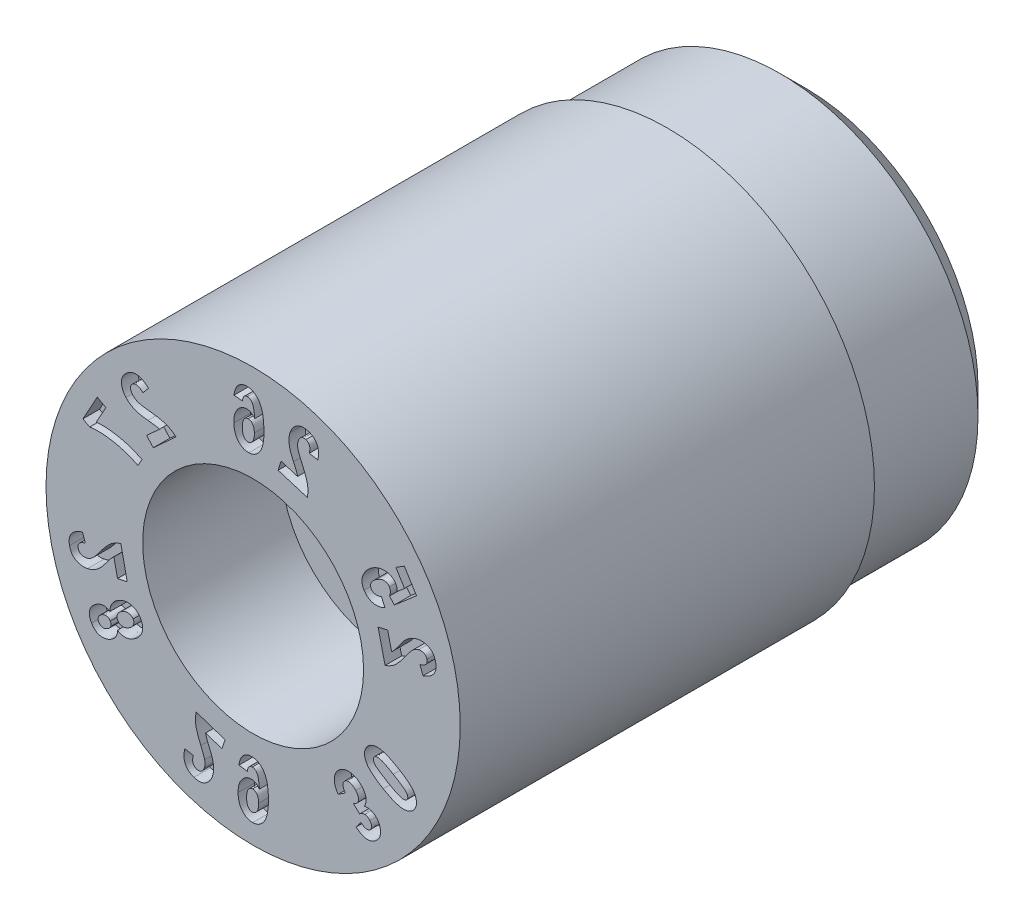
from build123d import *

# Parameters (mm, degrees)
SKETCH5_W          = 1
SKETCH5_H          = 1
CUT_EXTRUDE3_DEPTH = 0.12


with BuildPart() as part:
    # Sketch1 → Revolve1 (revolve)
    with BuildSketch(Plane(origin=(0, 0, 0), x_dir=(0, 0, -1), z_dir=(1, 0, 0)), mode=Mode.PRIVATE) as revolve1_sk:
        Polygon((0, 1.5), (0, 0.8), (1, 0.8), (1, 0.5), (4, 0.5), (4, 1.25), (3.75, 1.5), align=None)
    revolve(revolve1_sk.sketch.rotate(Axis((0, 0, 3.797909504), (0, 0, -1)), 90), axis=Axis((0, 0, 3.797909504), (0, 0, -1)))

    # Sketch5 → Cut-Revolve1 (revolve, cut)
    with BuildSketch(Plane(origin=(0, 0, 0), x_dir=(0, 0, -1), z_dir=(1, 0, 0)), mode=Mode.PRIVATE) as cut_revolve1_sk:
        with Locations((3.5, 1.935)):
            Rectangle(SKETCH5_W, SKETCH5_H)
    revolve(cut_revolve1_sk.sketch.rotate(Axis((0, 0, 0), (0, 0, -1)), 90), axis=Axis((0, 0, 0), (0, 0, -1)), mode=Mode.SUBTRACT)

    # Sketch12 → Cut-Extrude3 (cut)
    # profile 1 of 12: a face of its own
    with BuildSketch(Plane.XY):
        with BuildLine():
            Line((0.974609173, 0.338144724), (0.905148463, 0.321745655))
            Line((0.905148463, 0.321745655), (0.955971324, 0.10664616))
            add(Edge.make_bspline(
                [(0.955971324, 0.10664616), (0.962315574, 0.108938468), (0.9749237, 0.113494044), (0.992944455, 0.122459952), (1.010020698, 0.133080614), (1.023609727, 0.14335984), (1.034378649, 0.152803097), (1.042804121, 0.161254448), (1.051780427, 0.170814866), (1.061181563, 0.181607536), (1.071021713, 0.19360956), (1.081394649, 0.206736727), (1.092033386, 0.221178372), (1.09923475, 0.231232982), (1.102955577, 0.236428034)],
                knots=[0, 0, 0, 0, 1.213893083, 2.412407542, 3.616139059, 4.830628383, 5.475865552, 6.193816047, 6.978445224, 7.837046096, 8.770495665, 9.772985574, 10.849338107, 12, 12, 12, 12], degree=3))
            add(Edge.make_bspline(
                [(1.102955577, 0.236428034), (1.105862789, 0.240524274), (1.111410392, 0.248340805), (1.119537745, 0.259338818), (1.126882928, 0.269197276), (1.133503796, 0.277877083), (1.139508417, 0.28532577), (1.14481139, 0.291570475), (1.149295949, 0.296733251), (1.15224648, 0.299573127), (1.153560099, 0.300837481)],
                knots=[0, 0, 0, 0, 1.470113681, 2.80530214, 4.002305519, 5.068324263, 6.000261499, 6.801944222, 7.466608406, 8, 8, 8, 8], degree=3))
            add(Edge.make_bspline(
                [(1.153560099, 0.300837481), (1.156958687, 0.303909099), (1.16357661, 0.309890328), (1.174586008, 0.317015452), (1.185919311, 0.322676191), (1.193908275, 0.324906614), (1.19787527, 0.326014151)],
                knots=[0, 0, 0, 0, 1.064698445, 2.073241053, 3.043249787, 4, 4, 4, 4], degree=3))
            add(Edge.make_bspline(
                [(1.19787527, 0.326014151), (1.201924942, 0.326825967), (1.209539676, 0.328352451), (1.22062684, 0.328792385), (1.230511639, 0.327364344), (1.239163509, 0.324062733), (1.246461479, 0.319186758), (1.252373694, 0.312932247), (1.256840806, 0.305341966), (1.258458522, 0.299639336), (1.259296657, 0.296684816)],
                knots=[0, 0, 0, 0, 1.286861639, 2.41972907, 3.44296348, 4.380779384, 5.284129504, 6.157128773, 7.045212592, 8, 8, 8, 8], degree=3))
            add(Edge.make_bspline(
                [(1.259296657, 0.296684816), (1.259926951, 0.293416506), (1.261135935, 0.28714747), (1.260086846, 0.277767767), (1.257100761, 0.269079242), (1.251526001, 0.261321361), (1.243938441, 0.25429521), (1.23416358, 0.248073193), (1.222226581, 0.242691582), (1.213417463, 0.239872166), (1.208735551, 0.23837369)],
                knots=[0, 0, 0, 0, 0.918120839, 1.761073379, 2.583477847, 3.439679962, 4.379580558, 5.436722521, 6.637657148, 8, 8, 8, 8], degree=3))
            Line((1.208735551, 0.23837369), (1.230664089, 0.17910678))
            add(Edge.make_bspline(
                [(1.230664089, 0.17910678), (1.23535633, 0.180779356), (1.244438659, 0.184016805), (1.257329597, 0.189580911), (1.26899065, 0.195717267), (1.279676, 0.202077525), (1.289030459, 0.209190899), (1.297418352, 0.216531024), (1.304512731, 0.224475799), (1.310503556, 0.232841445), (1.315380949, 0.241631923), (1.319207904, 0.250799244), (1.322188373, 0.260255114), (1.323991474, 0.270141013), (1.324778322, 0.28036738), (1.324624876, 0.290957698), (1.323321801, 0.301884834), (1.321802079, 0.309205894), (1.321025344, 0.312947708)],
                knots=[0, 0, 0, 0, 1.321152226, 2.557229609, 3.720050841, 4.814888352, 5.850918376, 6.832839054, 7.767048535, 8.669200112, 9.557022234, 10.427296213, 11.300376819, 12.181677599, 13.086309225, 14.017204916, 14.986587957, 16, 16, 16, 16], degree=3))
            add(Edge.make_bspline(
                [(1.321025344, 0.312947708), (1.319970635, 0.317002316), (1.31792302, 0.324873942), (1.313647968, 0.335965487), (1.308582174, 0.346060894), (1.302583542, 0.35510977), (1.295861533, 0.363284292), (1.288120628, 0.370267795), (1.279630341, 0.37632434), (1.270354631, 0.381213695), (1.260658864, 0.385242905), (1.250746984, 0.388342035), (1.240775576, 0.390712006), (1.230644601, 0.392012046), (1.220429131, 0.3926537), (1.210056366, 0.392308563), (1.199609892, 0.391109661), (1.192688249, 0.38963744), (1.189200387, 0.388895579)],
                knots=[0, 0, 0, 0, 1.174391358, 2.279966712, 3.327326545, 4.336455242, 5.319446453, 6.287707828, 7.252005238, 8.237483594, 9.22202635, 10.193494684, 11.147734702, 12.092877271, 13.054932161, 14.015938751, 15.000218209, 16, 16, 16, 16], degree=3))
            add(Edge.make_bspline(
                [(1.189200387, 0.388895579), (1.185251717, 0.387862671), (1.177422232, 0.385814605), (1.165949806, 0.381834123), (1.154895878, 0.377010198), (1.144126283, 0.371496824), (1.133693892, 0.365071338), (1.123462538, 0.357809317), (1.113457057, 0.34956034), (1.105181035, 0.342093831), (1.098521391, 0.335394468), (1.093233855, 0.329675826), (1.087714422, 0.323283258), (1.081960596, 0.316220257), (1.075962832, 0.308480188), (1.069549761, 0.300174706), (1.063061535, 0.29106488), (1.058616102, 0.284795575), (1.056326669, 0.281566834)],
                knots=[0, 0, 0, 0, 1.117855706, 2.216501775, 3.322499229, 4.419593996, 5.528196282, 6.676118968, 7.853924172, 9.078742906, 9.728012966, 10.441119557, 11.211980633, 12.041344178, 12.936494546, 13.894495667, 14.915648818, 16, 16, 16, 16], degree=3))
            add(Edge.make_bspline(
                [(1.056326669, 0.281566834), (1.054253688, 0.278584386), (1.050294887, 0.272888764), (1.044453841, 0.264877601), (1.039345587, 0.257549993), (1.034662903, 0.251153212), (1.030498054, 0.245640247), (1.026938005, 0.240928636), (1.023894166, 0.237070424), (1.01931627, 0.231391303), (1.012798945, 0.224259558), (1.006489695, 0.218819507), (1.003470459, 0.216216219)],
                knots=[0, 0, 0, 0, 1.292399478, 2.468114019, 3.527722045, 4.470738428, 5.288803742, 5.986325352, 6.572030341, 7.037354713, 8.582251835, 10, 10, 10, 10], degree=3))
            Line((1.003470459, 0.216216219), (0.974609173, 0.338144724))
        make_face()
    # profile 2 of 12: a face of its own
    with BuildSketch(Plane.XY):
        with BuildLine():
            Line((0.955259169, 0.468180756), (0.92869996, 0.525968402))
            add(Edge.make_bspline(
                [(0.92869996, 0.525968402), (0.92488046, 0.524198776), (0.917558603, 0.520806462), (0.906226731, 0.517808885), (0.895351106, 0.516575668), (0.88508905, 0.517515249), (0.875830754, 0.520005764), (0.867719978, 0.523693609), (0.861012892, 0.528896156), (0.857778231, 0.533307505), (0.856168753, 0.53550247)],
                knots=[0, 0, 0, 0, 1.260789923, 2.416893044, 3.500173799, 4.528216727, 5.488148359, 6.364961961, 7.186450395, 8, 8, 8, 8], degree=3))
            add(Edge.make_bspline(
                [(0.856168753, 0.53550247), (0.855374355, 0.536883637), (0.853786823, 0.539643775), (0.85210555, 0.544101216), (0.85111652, 0.548750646), (0.850672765, 0.553534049), (0.850718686, 0.558490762), (0.85157811, 0.56358001), (0.852886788, 0.568860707), (0.854871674, 0.574280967), (0.857504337, 0.579836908), (0.86097633, 0.585348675), (0.865295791, 0.590791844), (0.87023344, 0.596323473), (0.876137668, 0.601640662), (0.88269694, 0.60700287), (0.889979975, 0.612427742), (0.895267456, 0.615767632), (0.898006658, 0.617497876)],
                knots=[0, 0, 0, 0, 0.746835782, 1.492483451, 2.224163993, 2.971107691, 3.743515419, 4.542593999, 5.386797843, 6.293960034, 7.246288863, 8.267082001, 9.342776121, 10.504288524, 11.742189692, 13.06617063, 14.48011698, 16, 16, 16, 16], degree=3))
            add(Edge.make_bspline(
                [(0.898006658, 0.617497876), (0.900633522, 0.619086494), (0.905696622, 0.622148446), (0.913312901, 0.626127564), (0.920639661, 0.629411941), (0.927683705, 0.632000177), (0.934430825, 0.633856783), (0.94085682, 0.635083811), (0.946989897, 0.635615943), (0.952824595, 0.635368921), (0.9583153, 0.634539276), (0.96351174, 0.633291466), (0.968316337, 0.631439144), (0.972793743, 0.62913532), (0.976948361, 0.626384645), (0.980698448, 0.623064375), (0.984015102, 0.619192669), (0.985934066, 0.616348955), (0.986916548, 0.614893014)],
                knots=[0, 0, 0, 0, 1.47541934, 2.843769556, 4.127677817, 5.332750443, 6.447401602, 7.487879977, 8.473764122, 9.399475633, 10.287889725, 11.139955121, 11.963039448, 12.756510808, 13.55666929, 14.351737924, 15.156113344, 16, 16, 16, 16], degree=3))
            add(Edge.make_bspline(
                [(0.986916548, 0.614893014), (0.988022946, 0.612953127), (0.990240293, 0.609065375), (0.99253909, 0.602690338), (0.993941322, 0.595975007), (0.994466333, 0.588950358), (0.99412578, 0.581610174), (0.992813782, 0.573973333), (0.990808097, 0.565948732), (0.988808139, 0.560626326), (0.987772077, 0.557869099)],
                knots=[0, 0, 0, 0, 0.90317688, 1.810068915, 2.730824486, 3.674254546, 4.655616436, 5.698956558, 6.807963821, 8, 8, 8, 8], degree=3))
            Line((0.987772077, 0.557869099), (1.022637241, 0.519064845))
            Line((1.022637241, 0.519064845), (1.183413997, 0.657133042))
            Line((1.183413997, 0.657133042), (1.095119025, 0.799169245))
            Line((1.095119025, 0.799169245), (1.033785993, 0.761051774))
            Line((1.033785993, 0.761051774), (1.096645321, 0.659855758))
            Line((1.096645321, 0.659855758), (1.043979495, 0.615095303))
            add(Edge.make_bspline(
                [(1.043979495, 0.615095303), (1.043786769, 0.619146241), (1.043412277, 0.627017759), (1.041149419, 0.63844076), (1.03743747, 0.649075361), (1.033848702, 0.655546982), (1.032072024, 0.658750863)],
                knots=[0, 0, 0, 0, 1.061787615, 2.063196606, 3.04115395, 4, 4, 4, 4], degree=3))
            add(Edge.make_bspline(
                [(1.032072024, 0.658750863), (1.030313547, 0.661409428), (1.026834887, 0.666668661), (1.020709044, 0.673767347), (1.013934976, 0.680036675), (1.006571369, 0.685525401), (0.998532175, 0.69009839), (0.989944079, 0.693909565), (0.980705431, 0.696826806), (0.974277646, 0.698101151), (0.970993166, 0.698752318)],
                knots=[0, 0, 0, 0, 1.014062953, 2.006042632, 2.976354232, 3.947926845, 4.923196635, 5.914764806, 6.934483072, 8, 8, 8, 8], degree=3))
            add(Edge.make_bspline(
                [(0.970993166, 0.698752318), (0.96667898, 0.699317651), (0.958078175, 0.700444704), (0.944991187, 0.700574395), (0.931844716, 0.699329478), (0.918585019, 0.696783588), (0.90523536, 0.692909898), (0.891772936, 0.687758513), (0.878286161, 0.681166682), (0.869510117, 0.67595741), (0.865030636, 0.673298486)],
                knots=[0, 0, 0, 0, 0.936594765, 1.867204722, 2.811798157, 3.776934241, 4.771141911, 5.802228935, 6.87821043, 8, 8, 8, 8], degree=3))
            add(Edge.make_bspline(
                [(0.865030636, 0.673298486), (0.86134299, 0.67093703), (0.854014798, 0.666244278), (0.84387325, 0.658169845), (0.834285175, 0.649649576), (0.825581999, 0.640316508), (0.817389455, 0.630510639), (0.810025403, 0.619942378), (0.803319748, 0.608797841), (0.797441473, 0.597140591), (0.79262026, 0.585219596), (0.789332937, 0.573163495), (0.787782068, 0.561126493), (0.787789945, 0.549156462), (0.789369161, 0.537244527), (0.792602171, 0.525448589), (0.79739403, 0.513709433), (0.801733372, 0.506283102), (0.803962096, 0.502468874)],
                knots=[0, 0, 0, 0, 1.037751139, 2.062247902, 3.070197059, 4.076838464, 5.085298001, 6.097973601, 7.127920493, 8.167336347, 9.190888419, 10.172351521, 11.121923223, 12.060199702, 13.003333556, 13.962416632, 14.953479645, 16, 16, 16, 16], degree=3))
            add(Edge.make_bspline(
                [(0.803962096, 0.502468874), (0.80594507, 0.499464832), (0.809829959, 0.493579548), (0.816431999, 0.485484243), (0.82352487, 0.478218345), (0.831230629, 0.471873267), (0.839422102, 0.466363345), (0.848115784, 0.461667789), (0.857377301, 0.457953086), (0.867099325, 0.455025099), (0.87721596, 0.453094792), (0.887639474, 0.452145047), (0.89832363, 0.45224908), (0.909265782, 0.453351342), (0.920457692, 0.455514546), (0.931888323, 0.458665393), (0.943600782, 0.462850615), (0.951310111, 0.466375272), (0.955259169, 0.468180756)],
                knots=[0, 0, 0, 0, 1.004909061, 1.968738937, 2.912811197, 3.836703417, 4.751619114, 5.666566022, 6.59107623, 7.53408918, 8.498511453, 9.462696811, 10.452977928, 11.478366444, 12.530368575, 13.63307824, 14.787558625, 16, 16, 16, 16], degree=3))
        make_face()
    # profile 3 of 12: a face of its own
    with BuildSketch(Plane.XY):
        with BuildLine():
            Line((0.202187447, 1.011694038), (0.181131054, 0.943497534))
            Line((0.181131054, 0.943497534), (0.392293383, 0.878293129))
            add(Edge.make_bspline(
                [(0.392293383, 0.878293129), (0.393548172, 0.88488751), (0.396053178, 0.89805224), (0.397260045, 0.918123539), (0.396976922, 0.938244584), (0.394991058, 0.955190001), (0.392141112, 0.969219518), (0.389347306, 0.980820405), (0.38557226, 0.993390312), (0.381060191, 1.006958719), (0.375616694, 1.021473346), (0.36958894, 1.037048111), (0.362601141, 1.053582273), (0.357528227, 1.064874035), (0.354909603, 1.070702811)],
                knots=[0, 0, 0, 0, 1.208030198, 2.411658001, 3.613864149, 4.829723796, 5.477635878, 6.191994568, 6.978274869, 7.840913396, 8.767215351, 9.770227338, 10.8489976, 12, 12, 12, 12], degree=3))
            add(Edge.make_bspline(
                [(0.354909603, 1.070702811), (0.352865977, 1.075299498), (0.348974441, 1.084052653), (0.34359098, 1.096617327), (0.338797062, 1.107929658), (0.334741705, 1.118076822), (0.331308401, 1.127009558), (0.328466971, 1.134698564), (0.326401, 1.141212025), (0.3253837, 1.145180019), (0.32493105, 1.146945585)],
                knots=[0, 0, 0, 0, 1.472235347, 2.803477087, 4.000525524, 5.067872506, 6.001376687, 6.801296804, 7.466635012, 8, 8, 8, 8], degree=3))
            add(Edge.make_bspline(
                [(0.32493105, 1.146945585), (0.324012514, 1.151433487), (0.322224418, 1.160169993), (0.321776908, 1.17327276), (0.322638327, 1.185917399), (0.32479185, 1.193940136), (0.32586238, 1.197928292)],
                knots=[0, 0, 0, 0, 1.064066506, 2.071396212, 3.041278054, 4, 4, 4, 4], degree=3))
            add(Edge.make_bspline(
                [(0.32586238, 1.197928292), (0.327215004, 1.201825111), (0.32976408, 1.209168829), (0.334942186, 1.218966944), (0.341184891, 1.226782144), (0.348397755, 1.232556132), (0.356298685, 1.236365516), (0.364690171, 1.238310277), (0.37351306, 1.238318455), (0.379271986, 1.236843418), (0.382230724, 1.236085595)],
                knots=[0, 0, 0, 0, 1.285389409, 2.422369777, 3.43855933, 4.383500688, 5.279505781, 6.151462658, 7.050284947, 8, 8, 8, 8], degree=3))
            add(Edge.make_bspline(
                [(0.382230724, 1.236085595), (0.385324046, 1.234945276), (0.391297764, 1.232743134), (0.39892435, 1.227208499), (0.404814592, 1.220132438), (0.408834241, 1.211467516), (0.410876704, 1.20132235), (0.41127852, 1.189785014), (0.410064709, 1.176749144), (0.407960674, 1.167722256), (0.40684184, 1.162922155)],
                knots=[0, 0, 0, 0, 0.911170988, 1.759622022, 2.579264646, 3.44046812, 4.380249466, 5.431057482, 6.63394958, 8, 8, 8, 8], degree=3))
            Line((0.40684184, 1.162922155), (0.468984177, 1.151707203))
            add(Edge.make_bspline(
                [(0.468984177, 1.151707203), (0.469941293, 1.156594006), (0.471796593, 1.16606672), (0.473396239, 1.180030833), (0.474210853, 1.193209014), (0.473955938, 1.20564194), (0.47264696, 1.21730126), (0.470444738, 1.228206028), (0.467358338, 1.238388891), (0.463178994, 1.247769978), (0.458054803, 1.256390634), (0.452185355, 1.264404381), (0.445385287, 1.271653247), (0.437879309, 1.278346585), (0.429409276, 1.284136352), (0.420208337, 1.28935806), (0.41015188, 1.293847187), (0.403056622, 1.296252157), (0.399425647, 1.297482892)],
                knots=[0, 0, 0, 0, 1.320270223, 2.559248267, 3.724722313, 4.820039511, 5.852927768, 6.832383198, 7.767071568, 8.669239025, 9.548863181, 10.42261332, 11.298276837, 12.180356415, 13.084576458, 14.013655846, 14.983495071, 16, 16, 16, 16], degree=3))
            add(Edge.make_bspline(
                [(0.399425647, 1.297482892), (0.395409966, 1.298605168), (0.387579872, 1.300793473), (0.375853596, 1.302829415), (0.364537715, 1.303546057), (0.353681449, 1.30300773), (0.343290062, 1.301140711), (0.333307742, 1.298216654), (0.323835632, 1.293861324), (0.314915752, 1.288365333), (0.306608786, 1.281979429), (0.298825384, 1.275121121), (0.291758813, 1.267680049), (0.285406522, 1.259685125), (0.279761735, 1.251139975), (0.274841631, 1.242039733), (0.270612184, 1.232404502), (0.268350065, 1.225692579), (0.267205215, 1.222295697)],
                knots=[0, 0, 0, 0, 1.169271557, 2.279938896, 3.331777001, 4.344402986, 5.32132136, 6.287475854, 7.254703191, 8.236592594, 9.220738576, 10.190939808, 11.144337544, 12.095617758, 13.052152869, 14.013644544, 14.994712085, 16, 16, 16, 16], degree=3))
            add(Edge.make_bspline(
                [(0.267205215, 1.222295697), (0.266069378, 1.218391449), (0.26380566, 1.2106103), (0.261530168, 1.198714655), (0.260091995, 1.186747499), (0.259394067, 1.174689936), (0.259685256, 1.162456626), (0.260720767, 1.149956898), (0.262697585, 1.137159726), (0.265011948, 1.1262363), (0.267298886, 1.117079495), (0.269640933, 1.10964183), (0.272276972, 1.101595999), (0.275515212, 1.093047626), (0.279096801, 1.083908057), (0.283067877, 1.074211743), (0.287521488, 1.063974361), (0.290702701, 1.056999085), (0.292345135, 1.053397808)],
                knots=[0, 0, 0, 0, 1.113823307, 2.219844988, 3.314248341, 4.415487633, 5.526543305, 6.664900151, 7.850570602, 9.072481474, 9.723970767, 10.436137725, 11.208771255, 12.044013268, 12.940681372, 13.899026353, 14.915284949, 16, 16, 16, 16], degree=3))
            add(Edge.make_bspline(
                [(0.292345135, 1.053397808), (0.293851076, 1.050081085), (0.296722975, 1.043755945), (0.300719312, 1.034700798), (0.304406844, 1.026619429), (0.307484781, 1.019354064), (0.310216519, 1.013004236), (0.312472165, 1.007529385), (0.31428161, 1.002965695), (0.316763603, 0.996119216), (0.319619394, 0.986881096), (0.321124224, 0.978665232), (0.321845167, 0.974729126)],
                knots=[0, 0, 0, 0, 1.296648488, 2.472767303, 3.523325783, 4.458501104, 5.281396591, 5.983950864, 6.5663039, 7.028704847, 8.576494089, 10, 10, 10, 10], degree=3))
            Line((0.321845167, 0.974729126), (0.202187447, 1.011694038))
        make_face()
    # profile 4 of 12: a face of its own
    with BuildSketch(Plane.XY):
        with BuildLine():
            Line((-0.138157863, 1.25497351), (-0.076871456, 1.248397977))
            add(Edge.make_bspline(
                [(-0.076871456, 1.248397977), (-0.076532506, 1.251925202), (-0.075891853, 1.258592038), (-0.073778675, 1.267861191), (-0.070809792, 1.275785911), (-0.066869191, 1.282334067), (-0.061994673, 1.287528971), (-0.056184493, 1.291332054), (-0.049434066, 1.293695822), (-0.044622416, 1.294029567), (-0.042125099, 1.294202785)],
                knots=[0, 0, 0, 0, 1.326930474, 2.508041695, 3.552006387, 4.485756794, 5.353590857, 6.198797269, 7.065149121, 8, 8, 8, 8], degree=3))
            add(Edge.make_bspline(
                [(-0.042125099, 1.294202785), (-0.040437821, 1.294172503), (-0.037107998, 1.294112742), (-0.032203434, 1.293200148), (-0.02751106, 1.291549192), (-0.023069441, 1.289121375), (-0.018790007, 1.286061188), (-0.014803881, 1.282204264), (-0.010878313, 1.277782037), (-0.007235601, 1.272455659), (-0.003747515, 1.266113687), (-0.000771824, 1.258339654), (0.002142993, 1.249246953), (0.004635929, 1.238658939), (0.006967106, 1.226661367), (0.008848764, 1.213187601), (0.010722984, 1.198330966), (0.011586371, 1.187931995), (0.01203676, 1.182507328)],
                knots=[0, 0, 0, 0, 0.596106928, 1.176410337, 1.755766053, 2.348251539, 2.961025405, 3.610794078, 4.30578378, 5.049348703, 5.88828743, 6.859763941, 7.987878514, 9.264162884, 10.704173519, 12.309668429, 14.074923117, 16, 16, 16, 16], degree=3))
            add(Edge.make_bspline(
                [(0.01203676, 1.182507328), (0.010014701, 1.185162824), (0.006098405, 1.190305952), (-0.000604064, 1.196965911), (-0.007464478, 1.202727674), (-0.014745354, 1.207362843), (-0.022380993, 1.210929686), (-0.030356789, 1.213365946), (-0.038680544, 1.214816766), (-0.044337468, 1.214850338), (-0.047219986, 1.214867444)],
                knots=[0, 0, 0, 0, 1.136163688, 2.200506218, 3.212101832, 4.184270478, 5.132892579, 6.075039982, 7.019125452, 8, 8, 8, 8], degree=3))
            add(Edge.make_bspline(
                [(-0.047219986, 1.214867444), (-0.05038565, 1.214680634), (-0.056672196, 1.214309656), (-0.065887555, 1.212325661), (-0.074763, 1.209252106), (-0.08329213, 1.205062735), (-0.091449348, 1.199697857), (-0.099279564, 1.193264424), (-0.106715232, 1.185651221), (-0.113769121, 1.177066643), (-0.120299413, 1.167607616), (-0.125857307, 1.157278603), (-0.130548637, 1.146248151), (-0.134206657, 1.134470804), (-0.137130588, 1.122035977), (-0.138903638, 1.108849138), (-0.139969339, 1.094982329), (-0.139880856, 1.085493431), (-0.139835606, 1.080640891)],
                knots=[0, 0, 0, 0, 0.839855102, 1.667829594, 2.489689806, 3.325244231, 4.180402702, 5.072873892, 6.007155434, 6.997409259, 8.016150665, 9.049663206, 10.102075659, 11.189436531, 12.315786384, 13.484981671, 14.713841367, 16, 16, 16, 16], degree=3))
            add(Edge.make_bspline(
                [(-0.139835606, 1.080640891), (-0.139617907, 1.075476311), (-0.139194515, 1.065431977), (-0.137412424, 1.050816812), (-0.134582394, 1.037114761), (-0.130964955, 1.024233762), (-0.126392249, 1.01223542), (-0.120848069, 1.0011362), (-0.1143835, 0.990911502), (-0.10700944, 0.981646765), (-0.09901705, 0.973395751), (-0.090493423, 0.966256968), (-0.081615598, 0.960140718), (-0.07217419, 0.955364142), (-0.062416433, 0.951490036), (-0.052142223, 0.949130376), (-0.041496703, 0.947466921), (-0.034240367, 0.947496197), (-0.030544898, 0.947511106)],
                knots=[0, 0, 0, 0, 1.28577807, 2.50064555, 3.658346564, 4.763847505, 5.826117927, 6.84796706, 7.845762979, 8.830208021, 9.788977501, 10.698757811, 11.592735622, 12.46446218, 13.326360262, 14.197462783, 15.082013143, 16, 16, 16, 16], degree=3))
            add(Edge.make_bspline(
                [(-0.030544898, 0.947511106), (-0.026511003, 0.94773355), (-0.018580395, 0.948170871), (-0.007022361, 0.950825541), (0.003983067, 0.954786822), (0.014429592, 0.960227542), (0.024268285, 0.967179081), (0.03353427, 0.975557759), (0.042144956, 0.985481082), (0.050350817, 0.996722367), (0.057771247, 1.009716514), (0.063795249, 1.024706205), (0.069001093, 1.041483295), (0.073002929, 1.060166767), (0.076014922, 1.080735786), (0.077898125, 1.103197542), (0.078790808, 1.127571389), (0.078515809, 1.144439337), (0.078373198, 1.153186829)],
                knots=[0, 0, 0, 0, 0.745686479, 1.46601397, 2.182737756, 2.903429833, 3.636153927, 4.40405523, 5.206979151, 6.060777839, 6.973793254, 7.964930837, 9.040955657, 10.217950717, 11.493162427, 12.881725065, 14.382904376, 16, 16, 16, 16], degree=3))
            add(Edge.make_bspline(
                [(0.078373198, 1.153186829), (0.078031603, 1.162055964), (0.077372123, 1.179178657), (0.075140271, 1.203855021), (0.072031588, 1.226604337), (0.067869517, 1.247393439), (0.06263709, 1.266204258), (0.056474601, 1.28308904), (0.049236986, 1.298020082), (0.040984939, 1.311049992), (0.031904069, 1.322270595), (0.022269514, 1.331953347), (0.012083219, 1.340151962), (0.001259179, 1.346702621), (-0.010071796, 1.351870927), (-0.022033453, 1.355268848), (-0.034522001, 1.357367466), (-0.043027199, 1.357397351), (-0.047349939, 1.35741254)],
                knots=[0, 0, 0, 0, 1.587913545, 3.065615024, 4.431359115, 5.69457248, 6.856101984, 7.921776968, 8.906441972, 9.819167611, 10.67518031, 11.484106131, 12.259238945, 13.008496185, 13.742473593, 14.480431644, 15.227684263, 16, 16, 16, 16], degree=3))
            add(Edge.make_bspline(
                [(-0.047349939, 1.35741254), (-0.050325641, 1.357269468), (-0.056186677, 1.356987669), (-0.064760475, 1.35551722), (-0.072992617, 1.353426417), (-0.080841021, 1.350519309), (-0.088258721, 1.346732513), (-0.095384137, 1.342351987), (-0.102059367, 1.337066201), (-0.108357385, 1.331050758), (-0.114177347, 1.324259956), (-0.11947206, 1.316695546), (-0.124044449, 1.308311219), (-0.128081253, 1.299158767), (-0.131551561, 1.289229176), (-0.134386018, 1.278508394), (-0.136696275, 1.267024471), (-0.137660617, 1.25907336), (-0.138157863, 1.25497351)],
                knots=[0, 0, 0, 0, 0.944267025, 1.859857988, 2.753667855, 3.635863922, 4.508193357, 5.391849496, 6.284834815, 7.203678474, 8.150749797, 9.117299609, 10.127159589, 11.175038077, 12.28753273, 13.460086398, 14.690338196, 16, 16, 16, 16], degree=3))
        make_face()
        with BuildLine():
            add(Edge.make_bspline(
                [(0.009031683, 1.090761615), (0.009058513, 1.087672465), (0.009110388, 1.081699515), (0.008640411, 1.072993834), (0.007763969, 1.064835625), (0.006500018, 1.057197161), (0.004609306, 1.050139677), (0.002396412, 1.043610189), (-0.000361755, 1.037640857), (-0.003450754, 1.032203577), (-0.006964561, 1.027436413), (-0.010561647, 1.023232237), (-0.014328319, 1.019660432), (-0.018226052, 1.016684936), (-0.022282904, 1.014336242), (-0.026486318, 1.012624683), (-0.030850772, 1.011585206), (-0.033820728, 1.011349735), (-0.035307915, 1.011231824)],
                knots=[0, 0, 0, 0, 1.477509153, 2.856801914, 4.167533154, 5.401508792, 6.555805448, 7.658975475, 8.695199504, 9.696816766, 10.64481932, 11.523589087, 12.340620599, 13.123198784, 13.864104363, 14.576305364, 15.287093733, 16, 16, 16, 16], degree=3))
            add(Edge.make_bspline(
                [(-0.035307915, 1.011231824), (-0.038138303, 1.011338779), (-0.043757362, 1.011551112), (-0.051782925, 1.014695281), (-0.058960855, 1.01995347), (-0.06422107, 1.025855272), (-0.067832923, 1.031687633), (-0.070446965, 1.036795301), (-0.072408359, 1.042693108), (-0.074366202, 1.049154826), (-0.075691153, 1.056365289), (-0.076844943, 1.064192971), (-0.07758854, 1.072703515), (-0.077778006, 1.078601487), (-0.077876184, 1.081657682)],
                knots=[0, 0, 0, 0, 1.104505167, 2.192731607, 3.317992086, 4.570858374, 5.264507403, 6.005789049, 6.814835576, 7.697690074, 8.652127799, 9.685856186, 10.800863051, 12, 12, 12, 12], degree=3))
            add(Edge.make_bspline(
                [(-0.077876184, 1.081657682), (-0.077935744, 1.084826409), (-0.078050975, 1.090956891), (-0.077648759, 1.09984073), (-0.076984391, 1.108079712), (-0.075820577, 1.115661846), (-0.074241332, 1.122598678), (-0.072208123, 1.128870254), (-0.069822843, 1.134519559), (-0.066968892, 1.139457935), (-0.063834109, 1.143782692), (-0.060496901, 1.147582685), (-0.056968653, 1.150833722), (-0.053212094, 1.153532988), (-0.049233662, 1.155602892), (-0.045024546, 1.157136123), (-0.040613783, 1.158104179), (-0.037591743, 1.158286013), (-0.036076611, 1.158377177)],
                knots=[0, 0, 0, 0, 1.561898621, 3.021779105, 4.381734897, 5.634668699, 6.799840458, 7.884769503, 8.880885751, 9.816881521, 10.689640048, 11.510187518, 12.305972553, 13.049644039, 13.783685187, 14.509317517, 15.252630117, 16, 16, 16, 16], degree=3))
            add(Edge.make_bspline(
                [(-0.036076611, 1.158377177), (-0.03313526, 1.158252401), (-0.027320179, 1.158005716), (-0.018947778, 1.154738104), (-0.01134767, 1.149325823), (-0.005741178, 1.143238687), (-0.00170939, 1.137402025), (0.00095776, 1.132312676), (0.003271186, 1.126715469), (0.005205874, 1.12058644), (0.006748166, 1.113897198), (0.00790379, 1.106651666), (0.00871098, 1.098877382), (0.008922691, 1.093519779), (0.009031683, 1.090761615)],
                knots=[0, 0, 0, 0, 1.165187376, 2.303587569, 3.516428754, 4.854017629, 5.574391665, 6.335631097, 7.136158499, 7.982535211, 8.890914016, 9.866166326, 10.901474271, 12, 12, 12, 12], degree=3))
        make_face(mode=Mode.SUBTRACT)
    # profile 5 of 12: a face of its own
    with BuildSketch(Plane.XY):
        with BuildLine():
            Line((-0.771320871, 0.685755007), (-0.722856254, 0.632832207))
            Line((-0.722856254, 0.632832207), (-0.559117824, 0.782751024))
            add(Edge.make_bspline(
                [(-0.559117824, 0.782751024), (-0.564213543, 0.787181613), (-0.574368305, 0.796010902), (-0.591119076, 0.807324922), (-0.608759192, 0.817184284), (-0.624423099, 0.82410174), (-0.637976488, 0.828899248), (-0.649488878, 0.832251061), (-0.662281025, 0.835427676), (-0.676316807, 0.83837351), (-0.69164727, 0.841102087), (-0.708222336, 0.843767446), (-0.726119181, 0.846048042), (-0.738466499, 0.84744161), (-0.744840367, 0.848160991)],
                knots=[0, 0, 0, 0, 1.209953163, 2.41119758, 3.616677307, 4.830321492, 5.476371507, 6.193829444, 6.979552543, 7.839543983, 8.765087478, 9.771725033, 10.849731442, 12, 12, 12, 12], degree=3))
            add(Edge.make_bspline(
                [(-0.744840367, 0.848160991), (-0.749845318, 0.848699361), (-0.759426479, 0.849729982), (-0.77306344, 0.85150626), (-0.785347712, 0.853025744), (-0.796200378, 0.854676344), (-0.80568053, 0.85623707), (-0.813775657, 0.857774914), (-0.820506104, 0.859218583), (-0.824483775, 0.860347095), (-0.826255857, 0.860849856)],
                knots=[0, 0, 0, 0, 1.464726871, 2.803979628, 4.001616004, 5.066343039, 5.998061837, 6.797128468, 7.464111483, 8, 8, 8, 8], degree=3))
            add(Edge.make_bspline(
                [(-0.826255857, 0.860849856), (-0.830583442, 0.86235114), (-0.839031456, 0.865281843), (-0.850708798, 0.871366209), (-0.861184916, 0.878639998), (-0.867066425, 0.884568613), (-0.869988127, 0.887513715)],
                knots=[0, 0, 0, 0, 1.05983856, 2.068943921, 3.040727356, 4, 4, 4, 4], degree=3))
            add(Edge.make_bspline(
                [(-0.869988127, 0.887513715), (-0.872708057, 0.890659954), (-0.877814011, 0.896566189), (-0.883538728, 0.906133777), (-0.887240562, 0.915501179), (-0.888445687, 0.924757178), (-0.887787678, 0.933540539), (-0.88521054, 0.941793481), (-0.880692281, 0.949375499), (-0.876517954, 0.953612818), (-0.874370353, 0.955792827)],
                knots=[0, 0, 0, 0, 1.28873032, 2.419251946, 3.444667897, 4.392005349, 5.290630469, 6.158717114, 7.052699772, 8, 8, 8, 8], degree=3))
            add(Edge.make_bspline(
                [(-0.874370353, 0.955792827), (-0.87180769, 0.957912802), (-0.866875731, 0.961992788), (-0.858199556, 0.965854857), (-0.849054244, 0.967284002), (-0.839493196, 0.966366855), (-0.829623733, 0.963031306), (-0.819425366, 0.957431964), (-0.808725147, 0.949750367), (-0.801965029, 0.943332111), (-0.798374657, 0.939923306)],
                knots=[0, 0, 0, 0, 0.913639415, 1.758339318, 2.581424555, 3.439162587, 4.3800396, 5.432864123, 6.636566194, 8, 8, 8, 8], degree=3))
            Line((-0.798374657, 0.939923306), (-0.757216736, 0.988058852))
            add(Edge.make_bspline(
                [(-0.757216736, 0.988058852), (-0.760950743, 0.991388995), (-0.768188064, 0.997843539), (-0.779484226, 1.006301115), (-0.790438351, 1.013759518), (-0.801379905, 1.019792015), (-0.812093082, 1.024709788), (-0.82266288, 1.028432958), (-0.833100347, 1.030732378), (-0.843347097, 1.03192806), (-0.85344031, 1.031945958), (-0.863341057, 1.030757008), (-0.873099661, 1.028595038), (-0.882647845, 1.025382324), (-0.892047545, 1.021095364), (-0.901200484, 1.015703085), (-0.910254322, 1.009314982), (-0.915911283, 1.004367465), (-0.918807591, 1.001834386)],
                knots=[0, 0, 0, 0, 1.320161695, 2.558761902, 3.722180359, 4.815780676, 5.852606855, 6.831347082, 7.767761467, 8.667956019, 9.549974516, 10.42546214, 11.295103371, 12.184207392, 13.079856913, 14.017251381, 14.98485237, 16, 16, 16, 16], degree=3))
            add(Edge.make_bspline(
                [(-0.918807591, 1.001834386), (-0.921850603, 0.998927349), (-0.927750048, 0.993291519), (-0.935380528, 0.984099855), (-0.941728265, 0.974709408), (-0.946808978, 0.965061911), (-0.950611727, 0.955150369), (-0.952974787, 0.944944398), (-0.954089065, 0.934531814), (-0.953838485, 0.923994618), (-0.952534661, 0.913548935), (-0.950573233, 0.903314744), (-0.947649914, 0.893442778), (-0.943957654, 0.88388012), (-0.939369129, 0.874661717), (-0.934039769, 0.865741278), (-0.927874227, 0.857177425), (-0.923215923, 0.851832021), (-0.920864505, 0.849133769)],
                knots=[0, 0, 0, 0, 1.175176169, 2.278297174, 3.330607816, 4.337307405, 5.318706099, 6.288474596, 7.256325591, 8.237345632, 9.226373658, 10.195316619, 11.145796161, 12.099277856, 13.056200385, 14.01949314, 15.00028009, 16, 16, 16, 16], degree=3))
            add(Edge.make_bspline(
                [(-0.920864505, 0.849133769), (-0.918036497, 0.846181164), (-0.912400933, 0.840297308), (-0.903378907, 0.832102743), (-0.893671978, 0.824837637), (-0.883594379, 0.818084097), (-0.872855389, 0.812038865), (-0.861473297, 0.806619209), (-0.849346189, 0.801909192), (-0.838744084, 0.798328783), (-0.829619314, 0.79579713), (-0.822009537, 0.793970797), (-0.813674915, 0.792286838), (-0.804656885, 0.790536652), (-0.794894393, 0.789043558), (-0.784449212, 0.787649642), (-0.77330912, 0.786183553), (-0.765631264, 0.785433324), (-0.761672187, 0.78504647)],
                knots=[0, 0, 0, 0, 1.114573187, 2.221085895, 3.318140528, 4.417301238, 5.526589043, 6.674900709, 7.851348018, 9.071637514, 9.724177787, 10.432537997, 11.204810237, 12.042323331, 12.936858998, 13.896857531, 14.915517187, 16, 16, 16, 16], degree=3))
            add(Edge.make_bspline(
                [(-0.761672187, 0.78504647), (-0.758039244, 0.78466439), (-0.751096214, 0.783934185), (-0.741189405, 0.782916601), (-0.732294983, 0.781846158), (-0.72441931, 0.78090822), (-0.717544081, 0.780033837), (-0.711657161, 0.779299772), (-0.706784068, 0.778522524), (-0.699581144, 0.777292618), (-0.690152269, 0.77502139), (-0.682298, 0.772125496), (-0.678527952, 0.770735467)],
                knots=[0, 0, 0, 0, 1.294779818, 2.474494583, 3.529776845, 4.470028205, 5.285678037, 5.986332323, 6.572573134, 7.034484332, 8.576552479, 10, 10, 10, 10], degree=3))
            Line((-0.678527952, 0.770735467), (-0.771320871, 0.685755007))
        make_face()
    # profile 6 of 12: a face of its own
    with BuildSketch(Plane.XY):
        with BuildLine():
            Line((-1.066229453, 0.712712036), (-1.128590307, 0.747101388))
            Line((-1.128590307, 0.747101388), (-1.232480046, 0.559183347))
            Line((-1.232480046, 0.559183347), (-1.183714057, 0.532271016))
            add(Edge.make_bspline(
                [(-1.183714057, 0.532271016), (-1.180210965, 0.532863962), (-1.172971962, 0.534089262), (-1.161685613, 0.535519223), (-1.149631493, 0.536424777), (-1.136853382, 0.536943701), (-1.1233385, 0.537141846), (-1.109065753, 0.537016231), (-1.094045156, 0.536325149), (-1.072968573, 0.535096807), (-1.045996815, 0.532309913), (-1.013382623, 0.527191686), (-0.980594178, 0.520167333), (-0.948066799, 0.511456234), (-0.916557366, 0.501431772), (-0.886967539, 0.49021046), (-0.859435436, 0.478538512), (-0.842334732, 0.469497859), (-0.834028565, 0.465106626)],
                knots=[0, 0, 0, 0, 0.471553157, 0.974446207, 1.509338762, 2.075481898, 2.671660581, 3.303228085, 3.969621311, 4.667206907, 6.10534672, 7.566466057, 9.047081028, 10.553856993, 12.034454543, 13.433613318, 14.75345278, 16, 16, 16, 16], degree=3))
            Line((-0.834028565, 0.465106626), (-0.804746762, 0.518039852))
            add(Edge.make_bspline(
                [(-0.804746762, 0.518039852), (-0.811081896, 0.521256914), (-0.823754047, 0.527691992), (-0.843195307, 0.53644003), (-0.86291681, 0.544673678), (-0.883052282, 0.552141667), (-0.903540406, 0.559040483), (-0.924392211, 0.565236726), (-0.945600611, 0.570728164), (-0.967064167, 0.575616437), (-0.988645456, 0.579734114), (-1.010135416, 0.583132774), (-1.031425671, 0.585824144), (-1.052564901, 0.587586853), (-1.07350281, 0.588890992), (-1.094286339, 0.58924989), (-1.114874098, 0.588962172), (-1.128514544, 0.588123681), (-1.135308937, 0.587706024)],
                knots=[0, 0, 0, 0, 0.997276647, 1.994849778, 2.991800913, 3.996829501, 5.008838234, 6.026057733, 7.049716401, 8.083694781, 9.115669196, 10.133243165, 11.137503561, 12.127288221, 13.110551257, 14.081820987, 15.044542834, 16, 16, 16, 16], degree=3))
            Line((-1.135308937, 0.587706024), (-1.066229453, 0.712712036))
        make_face()
    # profile 7 of 12: a face of its own
    with BuildSketch(Plane.XY):
        with BuildLine():
            Line((-0.982278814, -0.317670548), (-0.912053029, -0.302804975))
            Line((-0.912053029, -0.302804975), (-0.958165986, -0.085517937))
            add(Edge.make_bspline(
                [(-0.958165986, -0.085517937), (-0.964581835, -0.087653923), (-0.977344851, -0.09190303), (-0.995592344, -0.100598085), (-1.013022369, -0.1108091), (-1.026937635, -0.120799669), (-1.037953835, -0.130030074), (-1.046591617, -0.13833682), (-1.05589089, -0.147650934), (-1.065525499, -0.158327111), (-1.075724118, -0.170122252), (-1.086366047, -0.183137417), (-1.097488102, -0.197337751), (-1.104953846, -0.207281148), (-1.108814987, -0.212423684)],
                knots=[0, 0, 0, 0, 1.211175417, 2.409385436, 3.61502272, 4.828759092, 5.47498283, 6.189803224, 6.976081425, 7.83393884, 8.766866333, 9.771121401, 10.847266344, 12, 12, 12, 12], degree=3))
            add(Edge.make_bspline(
                [(-1.108814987, -0.212423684), (-1.111848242, -0.216446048), (-1.117644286, -0.224132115), (-1.126042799, -0.235008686), (-1.133545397, -0.244846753), (-1.140547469, -0.253301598), (-1.146687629, -0.260692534), (-1.152073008, -0.266920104), (-1.156729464, -0.271990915), (-1.159747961, -0.274813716), (-1.161092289, -0.276070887)],
                knots=[0, 0, 0, 0, 1.466492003, 2.802221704, 4.000315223, 5.067572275, 5.997481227, 6.797318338, 7.464369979, 8, 8, 8, 8], degree=3))
            add(Edge.make_bspline(
                [(-1.161092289, -0.276070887), (-1.164563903, -0.279050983), (-1.171336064, -0.284864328), (-1.182578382, -0.291729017), (-1.194120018, -0.297139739), (-1.20222535, -0.299199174), (-1.206231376, -0.300217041)],
                knots=[0, 0, 0, 0, 1.058844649, 2.065513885, 3.043888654, 4, 4, 4, 4], degree=3))
            add(Edge.make_bspline(
                [(-1.206231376, -0.300217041), (-1.21030267, -0.3009361), (-1.217982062, -0.30229241), (-1.229118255, -0.302437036), (-1.239073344, -0.300809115), (-1.247671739, -0.297241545), (-1.254945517, -0.292240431), (-1.260681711, -0.285809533), (-1.264956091, -0.278077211), (-1.266493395, -0.27233285), (-1.267291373, -0.26935109)],
                knots=[0, 0, 0, 0, 1.282048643, 2.418237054, 3.441099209, 4.391836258, 5.285088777, 6.159133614, 7.044450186, 8, 8, 8, 8], degree=3))
            add(Edge.make_bspline(
                [(-1.267291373, -0.26935109), (-1.267827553, -0.266060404), (-1.268857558, -0.259738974), (-1.267679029, -0.25029956), (-1.264310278, -0.241678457), (-1.258659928, -0.23393297), (-1.250824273, -0.227136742), (-1.240901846, -0.221126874), (-1.228823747, -0.215936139), (-1.219915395, -0.213305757), (-1.215187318, -0.211909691)],
                knots=[0, 0, 0, 0, 0.916785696, 1.761151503, 2.590577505, 3.447802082, 4.381090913, 5.436632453, 6.639501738, 8, 8, 8, 8], degree=3))
            Line((-1.215187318, -0.211909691), (-1.235682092, -0.152002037))
            add(Edge.make_bspline(
                [(-1.235682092, -0.152002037), (-1.240441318, -0.153539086), (-1.249658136, -0.156515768), (-1.26269765, -0.161904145), (-1.274613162, -0.16768272), (-1.285396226, -0.173967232), (-1.295060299, -0.180727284), (-1.303600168, -0.187970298), (-1.311031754, -0.195681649), (-1.317158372, -0.204009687), (-1.322304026, -0.212683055), (-1.326426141, -0.221780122), (-1.329514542, -0.231253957), (-1.331567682, -0.241141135), (-1.332587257, -0.251406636), (-1.332671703, -0.262047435), (-1.331709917, -0.273076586), (-1.330313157, -0.280463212), (-1.329597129, -0.284249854)],
                knots=[0, 0, 0, 0, 1.319749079, 2.555853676, 3.720809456, 4.813181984, 5.846892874, 6.829941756, 7.765015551, 8.666849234, 9.552732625, 10.422842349, 11.297716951, 12.177794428, 13.083156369, 14.016482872, 14.983180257, 16, 16, 16, 16], degree=3))
            add(Edge.make_bspline(
                [(-1.329597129, -0.284249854), (-1.328637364, -0.288340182), (-1.326772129, -0.29628944), (-1.322746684, -0.307543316), (-1.317828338, -0.317793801), (-1.312169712, -0.327140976), (-1.305434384, -0.335348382), (-1.297908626, -0.342571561), (-1.28961065, -0.348948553), (-1.280322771, -0.353957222), (-1.270700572, -0.358250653), (-1.260791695, -0.361558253), (-1.250823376, -0.364257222), (-1.240662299, -0.365817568), (-1.230397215, -0.366634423), (-1.220007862, -0.366568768), (-1.209479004, -0.365532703), (-1.202483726, -0.364245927), (-1.198939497, -0.363593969)],
                knots=[0, 0, 0, 0, 1.172028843, 2.27775346, 3.327923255, 4.341503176, 5.31980732, 6.281856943, 7.248637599, 8.230404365, 9.219492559, 10.186774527, 11.143294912, 12.098472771, 13.051378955, 14.015264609, 14.994413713, 16, 16, 16, 16], degree=3))
            add(Edge.make_bspline(
                [(-1.198939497, -0.363593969), (-1.194939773, -0.362693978), (-1.186984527, -0.360903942), (-1.175455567, -0.357000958), (-1.16423909, -0.35253227), (-1.153409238, -0.347120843), (-1.142728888, -0.341004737), (-1.132349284, -0.333827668), (-1.122051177, -0.325881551), (-1.113637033, -0.318505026), (-1.106790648, -0.311936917), (-1.101322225, -0.306308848), (-1.09558765, -0.300022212), (-1.089607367, -0.293061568), (-1.083280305, -0.28549314), (-1.076823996, -0.277157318), (-1.069980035, -0.26826037), (-1.065398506, -0.262068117), (-1.063035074, -0.258873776)],
                knots=[0, 0, 0, 0, 1.117536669, 2.222723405, 3.315595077, 4.408740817, 5.522029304, 6.669930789, 7.847714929, 9.068551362, 9.719880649, 10.435251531, 11.208574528, 12.040526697, 12.938258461, 13.898970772, 14.916161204, 16, 16, 16, 16], degree=3))
            add(Edge.make_bspline(
                [(-1.063035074, -0.258873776), (-1.060841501, -0.255946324), (-1.056657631, -0.250362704), (-1.050692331, -0.24236053), (-1.045305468, -0.235182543), (-1.040482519, -0.228855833), (-1.036207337, -0.223393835), (-1.032546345, -0.218743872), (-1.029404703, -0.214934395), (-1.024661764, -0.209354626), (-1.01791683, -0.202387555), (-1.011472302, -0.197069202), (-1.008400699, -0.194534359)],
                knots=[0, 0, 0, 0, 1.296217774, 2.472316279, 3.536663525, 4.476253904, 5.291162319, 5.994431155, 6.573244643, 7.040661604, 8.589514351, 10, 10, 10, 10], degree=3))
            Line((-1.008400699, -0.194534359), (-0.982278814, -0.317670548))
        make_face()
    # profile 8 of 12: a face of its own
    with BuildSketch(Plane.XY):
        with BuildLine():
            add(Edge.make_bspline(
                [(-1.035851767, -0.550477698), (-1.039528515, -0.548336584), (-1.046709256, -0.544154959), (-1.058301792, -0.539905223), (-1.070070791, -0.537401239), (-1.082056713, -0.536711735), (-1.094203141, -0.537802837), (-1.106490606, -0.540849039), (-1.118993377, -0.545556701), (-1.12698965, -0.550004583), (-1.131106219, -0.552294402)],
                knots=[0, 0, 0, 0, 1.012276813, 1.976990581, 2.927421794, 3.870454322, 4.827163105, 5.822084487, 6.878784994, 8, 8, 8, 8], degree=3))
            add(Edge.make_bspline(
                [(-1.131106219, -0.552294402), (-1.134380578, -0.554321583), (-1.140785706, -0.558287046), (-1.149664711, -0.56489365), (-1.15749988, -0.572050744), (-1.164452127, -0.579565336), (-1.170509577, -0.587457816), (-1.175585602, -0.595815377), (-1.17969001, -0.604589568), (-1.182762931, -0.613759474), (-1.184915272, -0.62312813), (-1.185921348, -0.632618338), (-1.185980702, -0.642174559), (-1.184803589, -0.65175081), (-1.182771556, -0.661444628), (-1.179540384, -0.67113299), (-1.175370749, -0.680937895), (-1.171810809, -0.687235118), (-1.169988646, -0.690458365)],
                knots=[0, 0, 0, 0, 1.139398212, 2.228830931, 3.269534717, 4.275498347, 5.255015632, 6.20869793, 7.163690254, 8.115488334, 9.065769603, 10.002597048, 10.934312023, 11.887456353, 12.852366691, 13.860749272, 14.905020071, 16, 16, 16, 16], degree=3))
            add(Edge.make_bspline(
                [(-1.169988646, -0.690458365), (-1.167925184, -0.693768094), (-1.163911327, -0.700206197), (-1.157082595, -0.708953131), (-1.149939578, -0.716746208), (-1.142111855, -0.7232015), (-1.134016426, -0.728792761), (-1.125386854, -0.733130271), (-1.116350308, -0.736461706), (-1.106901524, -0.738561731), (-1.097281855, -0.739682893), (-1.087640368, -0.739960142), (-1.078049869, -0.739398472), (-1.068499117, -0.737994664), (-1.059053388, -0.735500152), (-1.049642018, -0.732216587), (-1.040189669, -0.728184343), (-1.03416094, -0.724730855), (-1.031097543, -0.722976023)],
                knots=[0, 0, 0, 0, 1.162592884, 2.261481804, 3.305293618, 4.308734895, 5.281225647, 6.234062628, 7.181415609, 8.146949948, 9.113562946, 10.066434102, 11.020261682, 11.97582886, 12.940654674, 13.929219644, 14.947767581, 16, 16, 16, 16], degree=3))
            add(Edge.make_bspline(
                [(-1.031097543, -0.722976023), (-1.027083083, -0.720460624), (-1.01929125, -0.715578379), (-1.009045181, -0.706768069), (-1.000377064, -0.697220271), (-0.99337322, -0.686883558), (-0.98800163, -0.67599059), (-0.984321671, -0.664715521), (-0.982144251, -0.653124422), (-0.982206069, -0.64531695), (-0.982237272, -0.641376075)],
                knots=[0, 0, 0, 0, 1.134794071, 2.202569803, 3.228764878, 4.219217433, 5.187095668, 6.131370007, 7.056796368, 8, 8, 8, 8], degree=3))
            add(Edge.make_bspline(
                [(-0.982237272, -0.641376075), (-0.977916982, -0.644027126), (-0.969450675, -0.649222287), (-0.955776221, -0.654527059), (-0.941853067, -0.6577503), (-0.927596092, -0.658534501), (-0.913010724, -0.657047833), (-0.89812723, -0.653336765), (-0.882903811, -0.647434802), (-0.873111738, -0.641980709), (-0.868039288, -0.639155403)],
                knots=[0, 0, 0, 0, 1.002089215, 1.963755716, 2.889633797, 3.821908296, 4.77754041, 5.782419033, 6.851257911, 8, 8, 8, 8], degree=3))
            add(Edge.make_bspline(
                [(-0.868039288, -0.639155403), (-0.862933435, -0.635945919), (-0.852954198, -0.629673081), (-0.839499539, -0.618800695), (-0.827971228, -0.606871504), (-0.818242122, -0.594190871), (-0.810507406, -0.580853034), (-0.804752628, -0.567140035), (-0.801192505, -0.553089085), (-0.79989816, -0.538824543), (-0.800583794, -0.524578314), (-0.803346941, -0.510574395), (-0.80802931, -0.4968175), (-0.812713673, -0.488262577), (-0.815103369, -0.483898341)],
                knots=[0, 0, 0, 0, 1.178754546, 2.303840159, 3.373102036, 4.416279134, 5.421873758, 6.380192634, 7.315833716, 8.244792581, 9.171397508, 10.095506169, 11.02843509, 12, 12, 12, 12], degree=3))
            add(Edge.make_bspline(
                [(-0.815103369, -0.483898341), (-0.817156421, -0.480581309), (-0.821183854, -0.474074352), (-0.828298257, -0.465269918), (-0.835954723, -0.457384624), (-0.844261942, -0.450471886), (-0.853172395, -0.44454374), (-0.862699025, -0.439548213), (-0.872905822, -0.435654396), (-0.883632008, -0.432668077), (-0.894748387, -0.430837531), (-0.90604182, -0.430033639), (-0.917452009, -0.430643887), (-0.929001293, -0.43224648), (-0.940643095, -0.435267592), (-0.952423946, -0.439427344), (-0.96434914, -0.44468219), (-0.972068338, -0.449063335), (-0.976006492, -0.451298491)],
                knots=[0, 0, 0, 0, 1.013912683, 1.988973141, 2.937483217, 3.869211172, 4.794456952, 5.716699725, 6.661311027, 7.630945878, 8.608137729, 9.587355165, 10.569930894, 11.574986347, 12.61570863, 13.692342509, 14.822687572, 16, 16, 16, 16], degree=3))
            add(Edge.make_bspline(
                [(-0.976006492, -0.451298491), (-0.980941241, -0.454376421), (-0.990532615, -0.460358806), (-1.003143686, -0.471052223), (-1.013949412, -0.48246607), (-1.022651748, -0.494840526), (-1.029256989, -0.507947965), (-1.03369472, -0.521672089), (-1.036127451, -0.535930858), (-1.035944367, -0.545591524), (-1.035851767, -0.550477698)],
                knots=[0, 0, 0, 0, 1.140562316, 2.216841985, 3.235954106, 4.219142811, 5.176048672, 6.10639936, 7.042254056, 8, 8, 8, 8], degree=3))
        make_face()
        with BuildLine():
            add(Edge.make_bspline(
                [(-1.096108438, -0.600959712), (-1.092853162, -0.599196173), (-1.086665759, -0.59584416), (-1.077124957, -0.59246807), (-1.067956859, -0.591288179), (-1.059372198, -0.591809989), (-1.051533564, -0.594171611), (-1.044599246, -0.597976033), (-1.038572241, -0.603233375), (-1.035660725, -0.607690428), (-1.034165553, -0.609979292)],
                knots=[0, 0, 0, 0, 1.261088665, 2.396990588, 3.426279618, 4.391825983, 5.307131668, 6.192490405, 7.071776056, 8, 8, 8, 8], degree=3))
            add(Edge.make_bspline(
                [(-1.034165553, -0.609979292), (-1.032859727, -0.612436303), (-1.030325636, -0.617204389), (-1.028619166, -0.625097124), (-1.028553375, -0.633070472), (-1.0302906, -0.64112044), (-1.033884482, -0.648972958), (-1.039466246, -0.656348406), (-1.046920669, -0.663167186), (-1.052869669, -0.666949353), (-1.055998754, -0.668938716)],
                knots=[0, 0, 0, 0, 0.939821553, 1.823821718, 2.707107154, 3.627371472, 4.593699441, 5.612459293, 6.744189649, 8, 8, 8, 8], degree=3))
            add(Edge.make_bspline(
                [(-1.055998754, -0.668938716), (-1.059164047, -0.670670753), (-1.06515547, -0.673949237), (-1.074529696, -0.677047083), (-1.0835278, -0.678356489), (-1.092080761, -0.677689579), (-1.099837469, -0.67535089), (-1.106776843, -0.67171018), (-1.112666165, -0.666467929), (-1.115575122, -0.662090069), (-1.117066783, -0.659845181)],
                knots=[0, 0, 0, 0, 1.247137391, 2.360642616, 3.398570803, 4.375393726, 5.305086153, 6.185675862, 7.069647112, 8, 8, 8, 8], degree=3))
            add(Edge.make_bspline(
                [(-1.117066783, -0.659845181), (-1.118384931, -0.657351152), (-1.120944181, -0.652508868), (-1.122652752, -0.644532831), (-1.12284799, -0.636480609), (-1.121034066, -0.628396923), (-1.117447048, -0.620557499), (-1.112015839, -0.613228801), (-1.104830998, -0.606530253), (-1.099101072, -0.602870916), (-1.096108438, -0.600959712)],
                knots=[0, 0, 0, 0, 0.959410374, 1.862743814, 2.756858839, 3.692517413, 4.665716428, 5.681345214, 6.789009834, 8, 8, 8, 8], degree=3))
        make_face(mode=Mode.SUBTRACT)
        with BuildLine():
            add(Edge.make_bspline(
                [(-0.950834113, -0.508543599), (-0.948545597, -0.507252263), (-0.944111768, -0.504750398), (-0.937396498, -0.501544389), (-0.93088783, -0.498929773), (-0.924544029, -0.496903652), (-0.918383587, -0.495446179), (-0.912386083, -0.494667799), (-0.906573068, -0.494489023), (-0.899268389, -0.495013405), (-0.890822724, -0.496920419), (-0.881828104, -0.500891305), (-0.87434457, -0.506743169), (-0.870841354, -0.51183056), (-0.869074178, -0.514396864)],
                knots=[0, 0, 0, 0, 1.036349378, 2.007849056, 2.933041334, 3.801255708, 4.632673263, 5.426808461, 6.182802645, 6.923036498, 8.311419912, 9.574520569, 10.776481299, 12, 12, 12, 12], degree=3))
            add(Edge.make_bspline(
                [(-0.869074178, -0.514396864), (-0.867671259, -0.517165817), (-0.864906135, -0.522623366), (-0.863327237, -0.53182654), (-0.863983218, -0.541337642), (-0.866350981, -0.549318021), (-0.86936491, -0.55566117), (-0.872332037, -0.560481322), (-0.87587609, -0.56527083), (-0.880153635, -0.569916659), (-0.885079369, -0.574451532), (-0.890699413, -0.578847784), (-0.896906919, -0.583229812), (-0.901349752, -0.585967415), (-0.903639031, -0.587378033)],
                knots=[0, 0, 0, 0, 1.231363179, 2.426990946, 3.666587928, 5.003340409, 5.716282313, 6.460968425, 7.255431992, 8.087073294, 8.973590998, 9.920783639, 10.928632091, 12, 12, 12, 12], degree=3))
            add(Edge.make_bspline(
                [(-0.903639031, -0.587378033), (-0.907662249, -0.58957443), (-0.915305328, -0.59374702), (-0.927176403, -0.597889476), (-0.938617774, -0.599854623), (-0.949469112, -0.599447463), (-0.959374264, -0.597158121), (-0.968007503, -0.59297511), (-0.975431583, -0.587157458), (-0.978856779, -0.581976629), (-0.980589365, -0.57935598)],
                knots=[0, 0, 0, 0, 1.272615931, 2.417642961, 3.478463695, 4.480903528, 5.417033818, 6.28322298, 7.131592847, 8, 8, 8, 8], degree=3))
            add(Edge.make_bspline(
                [(-0.980589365, -0.57935598), (-0.981989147, -0.576586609), (-0.984765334, -0.571094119), (-0.986380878, -0.561853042), (-0.985673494, -0.552272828), (-0.982948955, -0.542471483), (-0.977954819, -0.53283968), (-0.970836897, -0.523820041), (-0.961735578, -0.515499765), (-0.954572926, -0.510929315), (-0.950834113, -0.508543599)],
                knots=[0, 0, 0, 0, 0.867431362, 1.720375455, 2.593607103, 3.546092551, 4.556766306, 5.618197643, 6.756729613, 8, 8, 8, 8], degree=3))
        make_face(mode=Mode.SUBTRACT)
    # profile 9 of 12: a face of its own
    with BuildSketch(Plane.XY):
        with BuildLine():
            Line((-0.225382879, -1.006533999), (-0.202862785, -0.939013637))
            Line((-0.202862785, -0.939013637), (-0.41182037, -0.869295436))
            add(Edge.make_bspline(
                [(-0.41182037, -0.869295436), (-0.413208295, -0.87587067), (-0.415971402, -0.888960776), (-0.417825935, -0.908957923), (-0.417789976, -0.929023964), (-0.416231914, -0.945950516), (-0.413822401, -0.96000602), (-0.411218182, -0.971611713), (-0.40774366, -0.984177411), (-0.403587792, -0.997819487), (-0.398590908, -1.012432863), (-0.392770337, -1.028079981), (-0.386234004, -1.044741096), (-0.381447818, -1.056134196), (-0.37897661, -1.062016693)],
                knots=[0, 0, 0, 0, 1.21283473, 2.414535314, 3.618508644, 4.83267143, 5.479006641, 6.19290153, 6.97972495, 7.832932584, 8.768085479, 9.76833636, 10.847745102, 12, 12, 12, 12], degree=3))
            add(Edge.make_bspline(
                [(-0.37897661, -1.062016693), (-0.3770593, -1.066631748), (-0.373400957, -1.075437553), (-0.368180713, -1.088042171), (-0.363727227, -1.099476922), (-0.359909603, -1.109684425), (-0.356568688, -1.118591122), (-0.354126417, -1.12636342), (-0.352120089, -1.132869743), (-0.35120548, -1.136854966), (-0.350796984, -1.138634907)],
                knots=[0, 0, 0, 0, 1.467715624, 2.800490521, 4.006656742, 5.071351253, 6.00142371, 6.799526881, 7.463826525, 8, 8, 8, 8], degree=3))
            add(Edge.make_bspline(
                [(-0.350796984, -1.138634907), (-0.349991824, -1.143123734), (-0.348423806, -1.151865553), (-0.348168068, -1.16493133), (-0.34929977, -1.177516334), (-0.351607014, -1.185468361), (-0.352751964, -1.189414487)],
                knots=[0, 0, 0, 0, 1.063279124, 2.070695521, 3.04259925, 4, 4, 4, 4], degree=3))
            add(Edge.make_bspline(
                [(-0.352751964, -1.189414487), (-0.354155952, -1.193263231), (-0.356812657, -1.200546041), (-0.362436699, -1.210048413), (-0.368754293, -1.217805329), (-0.376137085, -1.223371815), (-0.384115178, -1.227045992), (-0.392520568, -1.228673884), (-0.401282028, -1.228559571), (-0.406951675, -1.226947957), (-0.409888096, -1.22611327)],
                knots=[0, 0, 0, 0, 1.279310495, 2.420782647, 3.438378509, 4.389579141, 5.287488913, 6.162765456, 7.048460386, 8, 8, 8, 8], degree=3))
            add(Edge.make_bspline(
                [(-0.409888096, -1.22611327), (-0.412979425, -1.224913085), (-0.418908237, -1.222611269), (-0.426366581, -1.216854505), (-0.432093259, -1.209694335), (-0.435795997, -1.200925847), (-0.437729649, -1.190808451), (-0.437930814, -1.179282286), (-0.436332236, -1.16632031), (-0.434031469, -1.15738239), (-0.432807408, -1.152627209)],
                knots=[0, 0, 0, 0, 0.918205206, 1.761011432, 2.585993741, 3.441866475, 4.379838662, 5.435157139, 6.63544412, 8, 8, 8, 8], degree=3))
            Line((-0.432807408, -1.152627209), (-0.49448177, -1.140170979))
            add(Edge.make_bspline(
                [(-0.49448177, -1.140170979), (-0.495535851, -1.144996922), (-0.497585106, -1.154379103), (-0.499502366, -1.168249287), (-0.500603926, -1.181363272), (-0.500569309, -1.193773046), (-0.499670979, -1.205437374), (-0.497628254, -1.216372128), (-0.494684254, -1.226562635), (-0.490783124, -1.236048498), (-0.485900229, -1.244779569), (-0.480204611, -1.252867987), (-0.473589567, -1.260218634), (-0.466231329, -1.266990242), (-0.457982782, -1.273041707), (-0.448895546, -1.278406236), (-0.438971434, -1.283097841), (-0.431961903, -1.285622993), (-0.428383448, -1.286912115)],
                knots=[0, 0, 0, 0, 1.314253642, 2.555058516, 3.723722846, 4.813969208, 5.854520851, 6.833021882, 7.769163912, 8.673180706, 9.556423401, 10.426355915, 11.300540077, 12.183312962, 13.083478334, 14.017873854, 14.988099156, 16, 16, 16, 16], degree=3))
            add(Edge.make_bspline(
                [(-0.428383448, -1.286912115), (-0.424392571, -1.288132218), (-0.416661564, -1.290495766), (-0.405023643, -1.292743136), (-0.393807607, -1.293847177), (-0.382977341, -1.293388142), (-0.372574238, -1.291988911), (-0.362583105, -1.28919386), (-0.353024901, -1.28512973), (-0.343948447, -1.279885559), (-0.335549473, -1.273644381), (-0.327638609, -1.26698071), (-0.320454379, -1.259702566), (-0.313949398, -1.251849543), (-0.308170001, -1.243424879), (-0.303005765, -1.234504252), (-0.298519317, -1.22502826), (-0.29614333, -1.218376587), (-0.294938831, -1.215004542)],
                knots=[0, 0, 0, 0, 1.173704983, 2.273666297, 3.330181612, 4.337393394, 5.317296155, 6.278290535, 7.24730548, 8.233107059, 9.220612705, 10.188550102, 11.141547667, 12.094423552, 13.054572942, 14.01318133, 14.992788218, 16, 16, 16, 16], degree=3))
            add(Edge.make_bspline(
                [(-0.294938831, -1.215004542), (-0.293708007, -1.211126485), (-0.291260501, -1.203414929), (-0.28881104, -1.191569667), (-0.286963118, -1.179714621), (-0.286072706, -1.167719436), (-0.286011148, -1.155526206), (-0.286822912, -1.143030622), (-0.288511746, -1.130221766), (-0.29055854, -1.119296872), (-0.292673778, -1.1101428), (-0.294847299, -1.10269334), (-0.297291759, -1.094619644), (-0.300319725, -1.086023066), (-0.303634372, -1.076822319), (-0.307418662, -1.06710263), (-0.31162648, -1.056825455), (-0.314634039, -1.049814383), (-0.316187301, -1.046193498)],
                knots=[0, 0, 0, 0, 1.118231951, 2.223615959, 3.322242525, 4.416248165, 5.527925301, 6.673161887, 7.857097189, 9.078890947, 9.728634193, 10.440003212, 11.212453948, 12.048282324, 12.946037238, 13.901974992, 14.916469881, 16, 16, 16, 16], degree=3))
            add(Edge.make_bspline(
                [(-0.316187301, -1.046193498), (-0.317584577, -1.04283441), (-0.320252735, -1.036420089), (-0.32421805, -1.027340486), (-0.327610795, -1.019106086), (-0.330457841, -1.011734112), (-0.333098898, -1.005373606), (-0.335219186, -0.999874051), (-0.336933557, -0.995313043), (-0.339210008, -0.988412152), (-0.341897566, -0.979186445), (-0.343184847, -0.970976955), (-0.343799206, -0.967058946)],
                knots=[0, 0, 0, 0, 1.298212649, 2.478992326, 3.535396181, 4.475941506, 5.29887442, 5.992750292, 6.579239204, 7.037210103, 8.585997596, 10, 10, 10, 10], degree=3))
            Line((-0.343799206, -0.967058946), (-0.225382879, -1.006533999))
        make_face()
    # profile 10 of 12: a face of its own
    with BuildSketch(Plane.XY):
        with BuildLine():
            Line((-0.102933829, -1.048194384), (-0.041848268, -1.056291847))
            add(Edge.make_bspline(
                [(-0.041848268, -1.056291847), (-0.041441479, -1.052783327), (-0.040672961, -1.046154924), (-0.038261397, -1.037021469), (-0.035205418, -1.02919407), (-0.031153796, -1.02275209), (-0.026144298, -1.01774459), (-0.02029982, -1.014088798), (-0.013568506, -1.011864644), (-0.00878262, -1.011643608), (-0.006304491, -1.011529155)],
                knots=[0, 0, 0, 0, 1.330433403, 2.51349508, 3.551884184, 4.488650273, 5.361678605, 6.199907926, 7.067913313, 8, 8, 8, 8], degree=3))
            add(Edge.make_bspline(
                [(-0.006304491, -1.011529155), (-0.004565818, -1.011602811), (-0.001164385, -1.011746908), (0.003799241, -1.012849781), (0.008572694, -1.014458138), (0.012996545, -1.017072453), (0.017248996, -1.020210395), (0.02129626, -1.024023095), (0.02495271, -1.028653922), (0.028577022, -1.033954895), (0.031804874, -1.040425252), (0.034638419, -1.048212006), (0.037262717, -1.057364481), (0.039574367, -1.067981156), (0.041550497, -1.080029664), (0.043206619, -1.093537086), (0.04469372, -1.108438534), (0.045362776, -1.11886711), (0.045711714, -1.124306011)],
                knots=[0, 0, 0, 0, 0.613056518, 1.199346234, 1.788429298, 2.383059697, 3.003803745, 3.652213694, 4.338280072, 5.082560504, 5.915376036, 6.882230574, 8.003806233, 9.273764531, 10.71504157, 12.311790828, 14.076457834, 16, 16, 16, 16], degree=3))
            add(Edge.make_bspline(
                [(0.045711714, -1.124306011), (0.043718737, -1.121651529), (0.039851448, -1.116500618), (0.033353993, -1.109654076), (0.026446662, -1.103883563), (0.019177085, -1.099063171), (0.011457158, -1.095395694), (0.003418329, -1.092558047), (-0.005124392, -1.091111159), (-0.010938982, -1.090900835), (-0.013893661, -1.090793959)],
                knots=[0, 0, 0, 0, 1.11717867, 2.167838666, 3.169968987, 4.142886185, 5.096411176, 6.041541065, 7.004810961, 8, 8, 8, 8], degree=3))
            add(Edge.make_bspline(
                [(-0.013893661, -1.090793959), (-0.016986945, -1.090880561), (-0.023114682, -1.091052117), (-0.032136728, -1.092954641), (-0.040919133, -1.09571499), (-0.049408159, -1.099704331), (-0.057526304, -1.104895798), (-0.065522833, -1.111005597), (-0.073057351, -1.118458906), (-0.080396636, -1.126789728), (-0.087112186, -1.136105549), (-0.093026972, -1.146232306), (-0.097878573, -1.157154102), (-0.102013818, -1.168713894), (-0.105035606, -1.181067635), (-0.107363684, -1.194112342), (-0.108640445, -1.207913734), (-0.108781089, -1.217356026), (-0.108852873, -1.222175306)],
                knots=[0, 0, 0, 0, 0.825146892, 1.634600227, 2.453007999, 3.280936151, 4.131401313, 5.023394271, 5.964050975, 6.957491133, 7.986858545, 9.026930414, 10.084561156, 11.175146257, 12.302409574, 13.477752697, 14.712662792, 16, 16, 16, 16], degree=3))
            add(Edge.make_bspline(
                [(-0.108852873, -1.222175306), (-0.108761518, -1.227345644), (-0.108583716, -1.23740856), (-0.107111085, -1.252054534), (-0.104659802, -1.265841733), (-0.10139897, -1.278825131), (-0.097107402, -1.290956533), (-0.091828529, -1.302215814), (-0.085564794, -1.312601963), (-0.078500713, -1.322136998), (-0.070626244, -1.330586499), (-0.062349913, -1.338063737), (-0.053528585, -1.34428154), (-0.04439244, -1.349534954), (-0.03467595, -1.353429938), (-0.024583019, -1.356344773), (-0.013987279, -1.357993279), (-0.006791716, -1.358230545), (-0.003132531, -1.358351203)],
                knots=[0, 0, 0, 0, 1.286128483, 2.503163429, 3.657388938, 4.767551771, 5.829847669, 6.853809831, 7.855854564, 8.842703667, 9.800378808, 10.725002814, 11.612367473, 12.48068565, 13.340745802, 14.209898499, 15.089673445, 16, 16, 16, 16], degree=3))
            add(Edge.make_bspline(
                [(-0.003132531, -1.358351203), (0.000933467, -1.358182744), (0.008958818, -1.357850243), (0.020729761, -1.355655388), (0.031921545, -1.351902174), (0.042548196, -1.346655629), (0.052630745, -1.339976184), (0.062129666, -1.33180465), (0.071021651, -1.322170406), (0.079385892, -1.311083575), (0.08705447, -1.298277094), (0.093436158, -1.283434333), (0.098917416, -1.266772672), (0.103434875, -1.248213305), (0.106798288, -1.227727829), (0.109228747, -1.205332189), (0.110740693, -1.181026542), (0.11084847, -1.164175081), (0.110904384, -1.155432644)],
                knots=[0, 0, 0, 0, 0.750815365, 1.481937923, 2.202432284, 2.924224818, 3.66425628, 4.430034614, 5.232412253, 6.08083834, 6.990850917, 7.981635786, 9.057637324, 10.227041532, 11.505195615, 12.888490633, 14.385767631, 16, 16, 16, 16], degree=3))
            add(Edge.make_bspline(
                [(0.110904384, -1.155432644), (0.110811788, -1.146528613), (0.110633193, -1.129355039), (0.108877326, -1.104586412), (0.106354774, -1.081710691), (0.102576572, -1.060810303), (0.097931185, -1.041775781), (0.092086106, -1.024754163), (0.085309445, -1.009573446), (0.077316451, -0.996404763), (0.06846113, -0.985005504), (0.059084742, -0.975053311), (0.048972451, -0.966711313), (0.038312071, -0.959735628), (0.026925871, -0.95443657), (0.014955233, -0.950665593), (0.002358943, -0.948400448), (-0.006245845, -0.948133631), (-0.010639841, -0.947997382)],
                knots=[0, 0, 0, 0, 1.587120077, 3.061144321, 4.424775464, 5.688030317, 6.845050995, 7.914316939, 8.892361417, 9.803137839, 10.65307643, 11.461774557, 12.235614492, 12.984813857, 13.727024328, 14.466848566, 15.217103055, 16, 16, 16, 16], degree=3))
            add(Edge.make_bspline(
                [(-0.010639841, -0.947997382), (-0.013673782, -0.948061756), (-0.019655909, -0.948188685), (-0.028394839, -0.949422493), (-0.036745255, -0.951302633), (-0.044634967, -0.954054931), (-0.052133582, -0.957543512), (-0.059286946, -0.961692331), (-0.065961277, -0.966746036), (-0.072166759, -0.972585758), (-0.078049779, -0.979113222), (-0.083267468, -0.986582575), (-0.087912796, -0.994871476), (-0.092130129, -1.003902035), (-0.095553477, -1.013837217), (-0.098742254, -1.024490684), (-0.101126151, -1.036059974), (-0.102319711, -1.044071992), (-0.102933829, -1.048194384)],
                knots=[0, 0, 0, 0, 0.963483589, 1.899733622, 2.798649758, 3.679501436, 4.548951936, 5.423361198, 6.301986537, 7.202422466, 8.1277144, 9.089124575, 10.090413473, 11.14420995, 12.251094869, 13.426157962, 14.675691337, 16, 16, 16, 16], degree=3))
        make_face()
        with BuildLine():
            add(Edge.make_bspline(
                [(0.040384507, -1.216058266), (0.040360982, -1.219117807), (0.040315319, -1.225056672), (0.039581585, -1.233699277), (0.038564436, -1.241827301), (0.036920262, -1.24937594), (0.03510896, -1.256443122), (0.032560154, -1.262885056), (0.029704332, -1.268841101), (0.026428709, -1.274229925), (0.022759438, -1.278918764), (0.019081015, -1.283130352), (0.015224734, -1.286668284), (0.011157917, -1.28947028), (0.00708958, -1.29182332), (0.002811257, -1.293388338), (-0.001558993, -1.294342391), (-0.004515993, -1.294492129), (-0.006008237, -1.294567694)],
                knots=[0, 0, 0, 0, 1.461220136, 2.836369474, 4.141635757, 5.371294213, 6.525459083, 7.622469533, 8.674618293, 9.678990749, 10.627929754, 11.51573385, 12.348772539, 13.119722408, 13.871801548, 14.587449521, 15.287159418, 16, 16, 16, 16], degree=3))
            add(Edge.make_bspline(
                [(-0.006008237, -1.294567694), (-0.008825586, -1.294384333), (-0.014429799, -1.294019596), (-0.022401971, -1.290723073), (-0.029377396, -1.285191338), (-0.034520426, -1.279222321), (-0.038039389, -1.273300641), (-0.040384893, -1.268015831), (-0.04245496, -1.262089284), (-0.044108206, -1.255469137), (-0.045321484, -1.248143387), (-0.046269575, -1.240132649), (-0.046776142, -1.231436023), (-0.046870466, -1.225425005), (-0.046919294, -1.222313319)],
                knots=[0, 0, 0, 0, 1.092499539, 2.173176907, 3.290878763, 4.530486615, 5.214501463, 5.963506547, 6.775507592, 7.653494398, 8.613655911, 9.661874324, 10.789636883, 12, 12, 12, 12], degree=3))
            add(Edge.make_bspline(
                [(-0.046919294, -1.222313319), (-0.046876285, -1.219174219), (-0.046793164, -1.213107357), (-0.046340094, -1.204315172), (-0.045271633, -1.196194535), (-0.04403837, -1.18869606), (-0.042130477, -1.181907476), (-0.040058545, -1.175715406), (-0.037443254, -1.170193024), (-0.034501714, -1.1652847), (-0.031151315, -1.161084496), (-0.027769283, -1.157324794), (-0.024106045, -1.154191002), (-0.020229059, -1.151664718), (-0.016181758, -1.149652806), (-0.011981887, -1.148138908), (-0.00754657, -1.147295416), (-0.004542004, -1.147196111), (-0.003023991, -1.147145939)],
                knots=[0, 0, 0, 0, 1.554195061, 3.003755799, 4.35440159, 5.607487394, 6.761062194, 7.841316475, 8.835797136, 9.779938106, 10.666863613, 11.491314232, 12.280182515, 13.045504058, 13.776292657, 14.513314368, 15.248874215, 16, 16, 16, 16], degree=3))
            add(Edge.make_bspline(
                [(-0.003023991, -1.147145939), (-0.000121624, -1.147350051), (0.005628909, -1.147754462), (0.013843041, -1.151228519), (0.021273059, -1.156807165), (0.026740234, -1.163029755), (0.030681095, -1.168943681), (0.033208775, -1.174143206), (0.035434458, -1.179796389), (0.037252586, -1.186007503), (0.038657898, -1.192758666), (0.039648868, -1.200049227), (0.04027225, -1.207878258), (0.040346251, -1.213270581), (0.040384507, -1.216058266)],
                knots=[0, 0, 0, 0, 1.150566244, 2.279645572, 3.487031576, 4.821258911, 5.552528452, 6.308097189, 7.115455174, 7.966863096, 8.87856371, 9.855619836, 10.891413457, 12, 12, 12, 12], degree=3))
        make_face(mode=Mode.SUBTRACT)
    # profile 11 of 12: a face of its own
    with BuildSketch(Plane.XY):
        with BuildLine():
            Line((0.616017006, -0.871098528), (0.667845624, -0.837786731))
            add(Edge.make_bspline(
                [(0.667845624, -0.837786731), (0.665299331, -0.834080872), (0.660459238, -0.827036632), (0.65518167, -0.815999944), (0.651775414, -0.805344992), (0.650851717, -0.795080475), (0.651506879, -0.785545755), (0.654121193, -0.776990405), (0.658208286, -0.769297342), (0.662304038, -0.765298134), (0.664372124, -0.763278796)],
                knots=[0, 0, 0, 0, 1.31199044, 2.493882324, 3.562342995, 4.561425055, 5.487625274, 6.336354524, 7.159968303, 8, 8, 8, 8], degree=3))
            add(Edge.make_bspline(
                [(0.664372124, -0.763278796), (0.666874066, -0.76138542), (0.6718482, -0.757621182), (0.680860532, -0.754424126), (0.690669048, -0.753596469), (0.701151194, -0.754778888), (0.711991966, -0.758326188), (0.722735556, -0.764430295), (0.733439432, -0.772693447), (0.739815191, -0.779656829), (0.743165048, -0.783315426)],
                knots=[0, 0, 0, 0, 0.828664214, 1.647475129, 2.495472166, 3.421773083, 4.428556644, 5.499047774, 6.685986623, 8, 8, 8, 8], degree=3))
            add(Edge.make_bspline(
                [(0.743165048, -0.783315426), (0.746104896, -0.786898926), (0.751677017, -0.793691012), (0.758084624, -0.804582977), (0.76218181, -0.815415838), (0.763960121, -0.826014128), (0.76380155, -0.836007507), (0.761482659, -0.844989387), (0.757502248, -0.853053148), (0.75331738, -0.857169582), (0.751195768, -0.859256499)],
                knots=[0, 0, 0, 0, 1.307879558, 2.478925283, 3.552514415, 4.560582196, 5.498282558, 6.352431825, 7.16472891, 8, 8, 8, 8], degree=3))
            add(Edge.make_bspline(
                [(0.751195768, -0.859256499), (0.749545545, -0.860596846), (0.746089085, -0.863404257), (0.740085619, -0.867049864), (0.733310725, -0.870673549), (0.728378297, -0.872763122), (0.725804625, -0.873853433)],
                knots=[0, 0, 0, 0, 0.866650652, 1.815235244, 2.860020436, 4, 4, 4, 4], degree=3))
            Line((0.725804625, -0.873853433), (0.772072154, -0.916452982))
            add(Edge.make_bspline(
                [(0.772072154, -0.916452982), (0.775008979, -0.913951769), (0.780611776, -0.90918002), (0.790117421, -0.904214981), (0.799801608, -0.901172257), (0.806379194, -0.901027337), (0.809624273, -0.900955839)],
                knots=[0, 0, 0, 0, 1.107755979, 2.113347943, 3.069212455, 4, 4, 4, 4], degree=3))
            add(Edge.make_bspline(
                [(0.809624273, -0.900955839), (0.812834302, -0.901371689), (0.819339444, -0.90221441), (0.828679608, -0.906336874), (0.837581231, -0.912548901), (0.842734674, -0.917995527), (0.845437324, -0.920851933)],
                knots=[0, 0, 0, 0, 0.919987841, 1.864361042, 2.879994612, 4, 4, 4, 4], degree=3))
            add(Edge.make_bspline(
                [(0.845437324, -0.920851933), (0.847519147, -0.923408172), (0.851473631, -0.928263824), (0.855805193, -0.93617456), (0.858610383, -0.944021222), (0.859517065, -0.951842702), (0.858891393, -0.959359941), (0.856600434, -0.966321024), (0.852831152, -0.97269576), (0.849258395, -0.976115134), (0.847417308, -0.97787718)],
                knots=[0, 0, 0, 0, 1.231162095, 2.338628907, 3.35721866, 4.329484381, 5.261664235, 6.157119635, 7.050340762, 8, 8, 8, 8], degree=3))
            add(Edge.make_bspline(
                [(0.847417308, -0.97787718), (0.845373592, -0.979447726), (0.841303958, -0.982575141), (0.834011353, -0.985364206), (0.826089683, -0.986552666), (0.817580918, -0.986004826), (0.808597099, -0.983704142), (0.799416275, -0.979307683), (0.790126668, -0.972851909), (0.784306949, -0.96746769), (0.781225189, -0.964616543)],
                knots=[0, 0, 0, 0, 0.826326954, 1.645457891, 2.480783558, 3.389527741, 4.371843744, 5.449235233, 6.649273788, 8, 8, 8, 8], degree=3))
            Line((0.781225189, -0.964616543), (0.745361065, -1.011955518))
            add(Edge.make_bspline(
                [(0.745361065, -1.011955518), (0.748864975, -1.014759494), (0.755657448, -1.020195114), (0.766005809, -1.027547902), (0.776203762, -1.033756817), (0.786215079, -1.038903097), (0.795966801, -1.043054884), (0.80557055, -1.046080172), (0.814950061, -1.048140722), (0.824165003, -1.049015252), (0.833143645, -1.049022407), (0.841933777, -1.048029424), (0.850525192, -1.046265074), (0.858931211, -1.04358164), (0.86711888, -1.039969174), (0.875171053, -1.035588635), (0.88298305, -1.030267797), (0.887899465, -1.026203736), (0.890407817, -1.024130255)],
                knots=[0, 0, 0, 0, 1.337613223, 2.593017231, 3.78128585, 4.893489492, 5.946075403, 6.936574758, 7.891053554, 8.803012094, 9.690423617, 10.562864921, 11.435268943, 12.301123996, 13.187765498, 14.099188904, 15.030207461, 16, 16, 16, 16], degree=3))
            add(Edge.make_bspline(
                [(0.890407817, -1.024130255), (0.89309371, -1.021672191), (0.898350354, -1.016861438), (0.90517461, -1.008866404), (0.910915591, -1.000527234), (0.915597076, -0.991800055), (0.919120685, -0.982671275), (0.921519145, -0.973181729), (0.922980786, -0.963345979), (0.923105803, -0.953251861), (0.922448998, -0.943168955), (0.920963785, -0.933366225), (0.91881102, -0.923932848), (0.915843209, -0.914889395), (0.912034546, -0.906252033), (0.907625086, -0.897921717), (0.902318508, -0.890019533), (0.898258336, -0.88512281), (0.896205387, -0.882646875)],
                knots=[0, 0, 0, 0, 1.106422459, 2.165413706, 3.188406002, 4.180350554, 5.170245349, 6.156165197, 7.151822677, 8.186790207, 9.219563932, 10.222099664, 11.1986355, 12.159127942, 13.111657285, 14.066281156, 15.022251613, 16, 16, 16, 16], degree=3))
            add(Edge.make_bspline(
                [(0.896205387, -0.882646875), (0.893283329, -0.879510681), (0.887570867, -0.873379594), (0.87775787, -0.865712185), (0.867362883, -0.85943609), (0.856225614, -0.854608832), (0.844409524, -0.851320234), (0.831892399, -0.849477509), (0.818709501, -0.849202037), (0.809770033, -0.8501017), (0.805194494, -0.85056218)],
                knots=[0, 0, 0, 0, 1.018850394, 1.991796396, 2.952324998, 3.902305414, 4.871258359, 5.863009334, 6.906211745, 8, 8, 8, 8], degree=3))
            add(Edge.make_bspline(
                [(0.805194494, -0.85056218), (0.806460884, -0.848565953), (0.808965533, -0.844617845), (0.812013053, -0.838354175), (0.814437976, -0.831904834), (0.816339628, -0.825259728), (0.817593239, -0.818351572), (0.818192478, -0.811230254), (0.81829562, -0.803924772), (0.817726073, -0.796480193), (0.816550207, -0.788968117), (0.814644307, -0.781468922), (0.812182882, -0.773989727), (0.808807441, -0.766666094), (0.804997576, -0.759318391), (0.800426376, -0.752041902), (0.795228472, -0.74481606), (0.791320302, -0.740196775), (0.789341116, -0.737857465)],
                knots=[0, 0, 0, 0, 0.92367204, 1.826825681, 2.717190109, 3.614751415, 4.525430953, 5.457243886, 6.405836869, 7.37882764, 8.37275268, 9.374526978, 10.401070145, 11.446085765, 12.523263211, 13.635197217, 14.802410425, 16, 16, 16, 16], degree=3))
            add(Edge.make_bspline(
                [(0.789341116, -0.737857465), (0.786308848, -0.734552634), (0.7803681, -0.728077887), (0.770743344, -0.719380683), (0.760761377, -0.711773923), (0.750393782, -0.705243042), (0.739592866, -0.699947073), (0.72845669, -0.69571766), (0.716947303, -0.692575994), (0.705153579, -0.69072447), (0.693428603, -0.689828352), (0.681979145, -0.690100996), (0.670968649, -0.691455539), (0.660417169, -0.693985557), (0.650347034, -0.697616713), (0.640647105, -0.702183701), (0.63146748, -0.708050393), (0.625818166, -0.712684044), (0.622961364, -0.715027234)],
                knots=[0, 0, 0, 0, 1.150534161, 2.254099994, 3.323746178, 4.367870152, 5.393264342, 6.405503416, 7.420904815, 8.448905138, 9.464567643, 10.434858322, 11.383060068, 12.306298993, 13.213099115, 14.125940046, 15.052306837, 16, 16, 16, 16], degree=3))
            add(Edge.make_bspline(
                [(0.622961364, -0.715027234), (0.620339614, -0.717411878), (0.615184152, -0.722101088), (0.608498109, -0.729958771), (0.602665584, -0.738184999), (0.597682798, -0.746809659), (0.59386813, -0.756000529), (0.590830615, -0.765535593), (0.588737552, -0.775545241), (0.587700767, -0.785937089), (0.587578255, -0.796528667), (0.58840799, -0.807225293), (0.590477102, -0.817892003), (0.593446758, -0.828595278), (0.597587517, -0.839238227), (0.602595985, -0.849967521), (0.608834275, -0.860628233), (0.613587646, -0.86755724), (0.616017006, -0.871098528)],
                knots=[0, 0, 0, 0, 0.983254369, 1.933491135, 2.857618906, 3.781196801, 4.692500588, 5.615161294, 6.556715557, 7.526356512, 8.510414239, 9.494816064, 10.499788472, 11.522796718, 12.575097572, 13.667068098, 14.807681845, 16, 16, 16, 16], degree=3))
        make_face()
    # profile 12 of 12: a face of its own
    with BuildSketch(Plane.XY):
        with BuildLine():
            add(Edge.make_bspline(
                [(1.17162946, -0.684291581), (1.173486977, -0.680853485), (1.177124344, -0.674121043), (1.18081972, -0.663347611), (1.183110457, -0.652401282), (1.183787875, -0.641189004), (1.182933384, -0.629768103), (1.180673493, -0.618127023), (1.17668128, -0.606335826), (1.171413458, -0.594176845), (1.163950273, -0.581866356), (1.154350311, -0.569290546), (1.142311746, -0.55659347), (1.128142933, -0.543467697), (1.111571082, -0.530242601), (1.092789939, -0.516625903), (1.071672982, -0.502798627), (1.056631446, -0.493792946), (1.048816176, -0.489113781)],
                knots=[0, 0, 0, 0, 0.727935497, 1.425434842, 2.115812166, 2.808786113, 3.513172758, 4.247380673, 5.014524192, 5.831146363, 6.714658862, 7.692590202, 8.777248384, 9.974432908, 11.293176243, 12.729714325, 14.300827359, 16, 16, 16, 16], degree=3))
            add(Edge.make_bspline(
                [(1.048816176, -0.489113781), (1.040924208, -0.484620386), (1.025747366, -0.475979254), (1.003354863, -0.464453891), (0.982312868, -0.454771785), (0.962622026, -0.446913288), (0.944250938, -0.441028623), (0.927265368, -0.436885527), (0.911615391, -0.434632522), (0.897216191, -0.434209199), (0.884038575, -0.435535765), (0.871853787, -0.437956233), (0.860593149, -0.441559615), (0.850291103, -0.446463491), (0.840878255, -0.452513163), (0.832460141, -0.459826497), (0.82500806, -0.468384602), (0.82092579, -0.474808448), (0.818846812, -0.478079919)],
                knots=[0, 0, 0, 0, 1.697444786, 3.2643125, 4.705934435, 6.025798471, 7.224735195, 8.30904486, 9.290260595, 10.174969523, 10.99454142, 11.76063836, 12.493633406, 13.198448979, 13.887463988, 14.578795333, 15.276223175, 16, 16, 16, 16], degree=3))
            add(Edge.make_bspline(
                [(0.818846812, -0.478079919), (0.816996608, -0.481520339), (0.813363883, -0.488275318), (0.809562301, -0.499037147), (0.807341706, -0.510007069), (0.806464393, -0.521196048), (0.80737176, -0.532589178), (0.809603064, -0.544178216), (0.813427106, -0.555951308), (0.818721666, -0.568015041), (0.826027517, -0.580353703), (0.835677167, -0.59289525), (0.847704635, -0.605683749), (0.862019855, -0.61877807), (0.878645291, -0.632182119), (0.897667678, -0.645819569), (0.918957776, -0.659886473), (0.934173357, -0.668957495), (0.94208144, -0.67367203)],
                knots=[0, 0, 0, 0, 0.725607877, 1.424671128, 2.112840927, 2.80216841, 3.504302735, 4.231391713, 4.992166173, 5.801170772, 6.676727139, 7.651531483, 8.737615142, 9.937297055, 11.256504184, 12.706358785, 14.288176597, 16, 16, 16, 16], degree=3))
            add(Edge.make_bspline(
                [(0.94208144, -0.67367203), (0.949933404, -0.678161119), (0.965043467, -0.686799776), (0.987394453, -0.698227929), (1.008358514, -0.707834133), (1.027995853, -0.715598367), (1.046280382, -0.721515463), (1.063255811, -0.72550134), (1.078856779, -0.727919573), (1.09322764, -0.728114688), (1.106421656, -0.72686828), (1.118634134, -0.724509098), (1.129918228, -0.720873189), (1.140241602, -0.716001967), (1.149564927, -0.709856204), (1.157975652, -0.702544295), (1.16546047, -0.694013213), (1.169552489, -0.687564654), (1.17162946, -0.684291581)],
                knots=[0, 0, 0, 0, 1.693685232, 3.259272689, 4.699508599, 6.010795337, 7.211991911, 8.294901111, 9.273949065, 10.162090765, 10.978582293, 11.752519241, 12.486895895, 13.19303996, 13.883669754, 14.571337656, 15.274858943, 16, 16, 16, 16], degree=3))
        make_face()
        with BuildLine():
            add(Edge.make_bspline(
                [(1.116715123, -0.652247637), (1.115880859, -0.653529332), (1.114249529, -0.656035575), (1.111005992, -0.659169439), (1.10727858, -0.661767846), (1.102957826, -0.663731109), (1.098083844, -0.664994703), (1.092724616, -0.665802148), (1.086823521, -0.665888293), (1.080195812, -0.665534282), (1.072447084, -0.664066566), (1.063262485, -0.661252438), (1.052459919, -0.65705821), (1.0400386, -0.65156068), (1.025997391, -0.644704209), (1.01027944, -0.636545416), (0.992943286, -0.626939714), (0.980880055, -0.620010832), (0.974546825, -0.61637315)],
                knots=[0, 0, 0, 0, 0.462846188, 0.905054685, 1.358555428, 1.836595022, 2.336492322, 2.882425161, 3.477525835, 4.124368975, 4.893985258, 5.863824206, 7.036129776, 8.409114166, 9.985336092, 11.777837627, 13.783353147, 16, 16, 16, 16], degree=3))
            add(Edge.make_bspline(
                [(0.974546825, -0.61637315), (0.968255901, -0.612677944), (0.95627494, -0.605640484), (0.939461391, -0.595224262), (0.924646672, -0.585569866), (0.911737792, -0.576812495), (0.900957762, -0.568574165), (0.891943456, -0.561343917), (0.885048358, -0.55469016), (0.879912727, -0.548713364), (0.8763389, -0.543125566), (0.873511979, -0.537969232), (0.871602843, -0.532911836), (0.870400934, -0.52805461), (0.869986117, -0.5233601), (0.870380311, -0.518837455), (0.87155562, -0.514468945), (0.872961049, -0.511800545), (0.873669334, -0.510455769)],
                knots=[0, 0, 0, 0, 2.218173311, 4.224474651, 6.012562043, 7.594557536, 8.965253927, 10.136999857, 11.105372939, 11.87498328, 12.526143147, 13.118648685, 13.659634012, 14.164717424, 14.635835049, 15.085342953, 15.539046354, 16, 16, 16, 16], degree=3))
            add(Edge.make_bspline(
                [(0.873669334, -0.510455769), (0.874508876, -0.509179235), (0.876168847, -0.506655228), (0.879387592, -0.50341057), (0.883164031, -0.500813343), (0.887508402, -0.498850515), (0.892374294, -0.497555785), (0.897761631, -0.496751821), (0.903661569, -0.496666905), (0.910309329, -0.497006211), (0.918044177, -0.498557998), (0.927177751, -0.501443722), (0.93797708, -0.505492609), (0.950307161, -0.511110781), (0.964324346, -0.517921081), (0.980022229, -0.525991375), (0.997246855, -0.535599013), (1.009238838, -0.542502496), (1.015536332, -0.546127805)],
                knots=[0, 0, 0, 0, 0.46351183, 0.916471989, 1.378815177, 1.849349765, 2.357939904, 2.904657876, 3.500614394, 4.148387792, 4.924401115, 5.889943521, 7.05761056, 8.427667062, 10.006155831, 11.794346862, 13.791435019, 16, 16, 16, 16], degree=3))
            add(Edge.make_bspline(
                [(1.015536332, -0.546127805), (1.021828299, -0.549821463), (1.033811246, -0.556855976), (1.050642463, -0.567311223), (1.065530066, -0.576922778), (1.078441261, -0.585756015), (1.089320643, -0.593883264), (1.098299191, -0.601182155), (1.105296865, -0.607739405), (1.11041996, -0.61374109), (1.11400913, -0.619349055), (1.116855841, -0.624527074), (1.118772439, -0.629637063), (1.120016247, -0.634510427), (1.120436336, -0.63927136), (1.120004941, -0.643828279), (1.118831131, -0.648234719), (1.117424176, -0.650902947), (1.116715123, -0.652247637)],
                knots=[0, 0, 0, 0, 2.212050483, 4.212813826, 6.007026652, 7.58465536, 8.954838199, 10.123349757, 11.091381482, 11.858867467, 12.508229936, 13.107300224, 13.646792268, 14.158369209, 14.628186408, 15.087867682, 15.540318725, 16, 16, 16, 16], degree=3))
        make_face(mode=Mode.SUBTRACT)
    extrude(amount=-CUT_EXTRUDE3_DEPTH, mode=Mode.SUBTRACT)


solid = part.part
